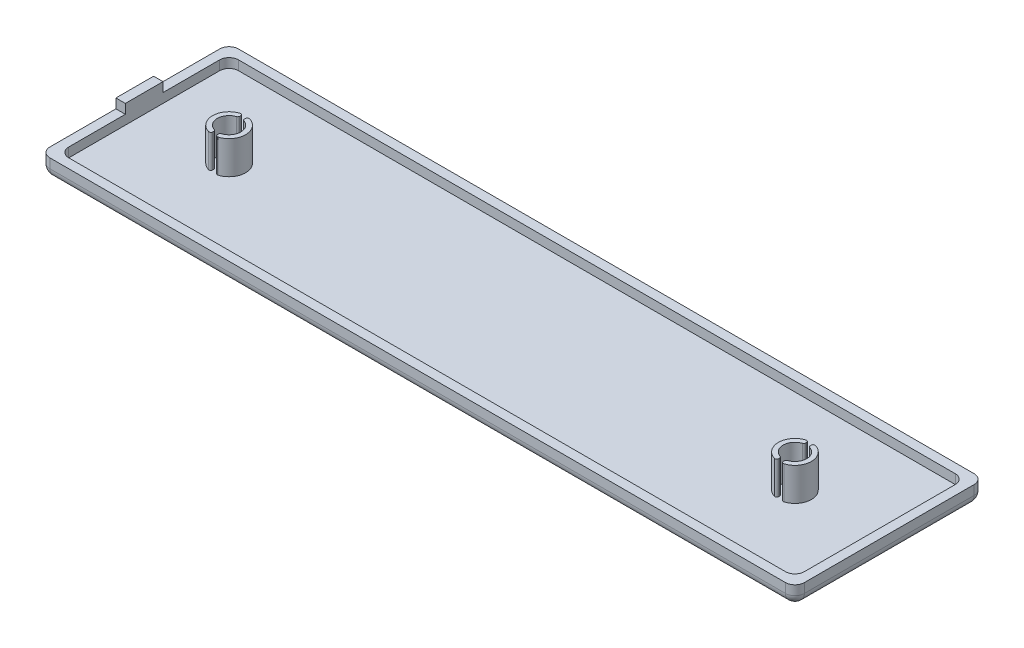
ISO-10303-21;
HEADER;
FILE_DESCRIPTION(('STEP AP214'),'2;1');
FILE_NAME('part.step','',(''),(''),'','','');
FILE_SCHEMA(('AUTOMOTIVE_DESIGN { 1 0 10303 214 1 1 1 1 }'));
ENDSEC;
DATA;
#1=APPLICATION_CONTEXT('core data for automotive mechanical design processes');
#2=APPLICATION_PROTOCOL_DEFINITION('international standard','automotive_design',2000,#1);
#3=PRODUCT_CONTEXT('',#1,'mechanical');
#4=PRODUCT('Part','Part','',(#3));
#5=PRODUCT_RELATED_PRODUCT_CATEGORY('part','',(#4));
#6=PRODUCT_DEFINITION_FORMATION('','',#4);
#7=PRODUCT_DEFINITION_CONTEXT('part definition',#1,'design');
#8=PRODUCT_DEFINITION('design','',#6,#7);
#9=PRODUCT_DEFINITION_SHAPE('','',#8);
#10=(LENGTH_UNIT() NAMED_UNIT(*) SI_UNIT(.MILLI.,.METRE.));
#11=(NAMED_UNIT(*) PLANE_ANGLE_UNIT() SI_UNIT($,.RADIAN.));
#12=(NAMED_UNIT(*) SI_UNIT($,.STERADIAN.) SOLID_ANGLE_UNIT());
#13=UNCERTAINTY_MEASURE_WITH_UNIT(LENGTH_MEASURE(1.E-05),#10,'distance_accuracy_value','');
#14=(GEOMETRIC_REPRESENTATION_CONTEXT(3) GLOBAL_UNCERTAINTY_ASSIGNED_CONTEXT((#13)) GLOBAL_UNIT_ASSIGNED_CONTEXT((#10,
#11,#12)) REPRESENTATION_CONTEXT('',''));
#15=CARTESIAN_POINT('',(0.,0.,0.));
#16=DIRECTION('',(0.,0.,1.));
#17=DIRECTION('',(1.,0.,0.));
#18=AXIS2_PLACEMENT_3D('',#15,#16,#17);
#19=CARTESIAN_POINT('',(0.,2.,0.));
#20=DIRECTION('',(0.,1.,0.));
#21=DIRECTION('',(0.,0.,1.));
#22=AXIS2_PLACEMENT_3D('',#19,#20,#21);
#23=PLANE('',#22);
#24=DIRECTION('',(1.,0.,0.));
#25=VECTOR('',#24,1.);
#26=CARTESIAN_POINT('',(0.,2.,-10.1864929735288));
#27=LINE('',#26,#25);
#28=CARTESIAN_POINT('',(-24.5518629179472,2.,-10.1864929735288));
#29=VERTEX_POINT('',#28);
#30=CARTESIAN_POINT('',(127.448137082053,2.,-10.1864929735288));
#31=VERTEX_POINT('',#30);
#32=EDGE_CURVE('E649',#29,#31,#27,.T.);
#33=ORIENTED_EDGE('',*,*,#32,.F.);
#34=CARTESIAN_POINT('',(-24.5518629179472,2.,-8.18649297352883));
#35=DIRECTION('',(0.,1.,0.));
#36=DIRECTION('',(0.,0.,1.));
#37=AXIS2_PLACEMENT_3D('',#34,#35,#36);
#38=CIRCLE('',#37,2.);
#39=CARTESIAN_POINT('',(-26.5518629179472,2.,-8.18649297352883));
#40=VERTEX_POINT('',#39);
#41=EDGE_CURVE('E501',#29,#40,#38,.T.);
#42=ORIENTED_EDGE('',*,*,#41,.T.);
#43=DIRECTION('',(0.,0.,1.));
#44=VECTOR('',#43,1.);
#45=CARTESIAN_POINT('',(-26.5518629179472,2.,0.));
#46=LINE('',#45,#44);
#47=CARTESIAN_POINT('',(-26.5518629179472,2.,23.8123254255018));
#48=VERTEX_POINT('',#47);
#49=EDGE_CURVE('E656',#40,#48,#46,.T.);
#50=ORIENTED_EDGE('',*,*,#49,.T.);
#51=CARTESIAN_POINT('',(-24.5518629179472,2.,23.8123254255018));
#52=DIRECTION('',(0.,1.,0.));
#53=DIRECTION('',(0.,0.,1.));
#54=AXIS2_PLACEMENT_3D('',#51,#52,#53);
#55=CIRCLE('',#54,2.);
#56=CARTESIAN_POINT('',(-24.5518629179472,2.,25.8123254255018));
#57=VERTEX_POINT('',#56);
#58=EDGE_CURVE('E492',#48,#57,#55,.T.);
#59=ORIENTED_EDGE('',*,*,#58,.T.);
#60=DIRECTION('',(1.,0.,0.));
#61=VECTOR('',#60,1.);
#62=CARTESIAN_POINT('',(0.,2.,25.8123254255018));
#63=LINE('',#62,#61);
#64=CARTESIAN_POINT('',(127.448137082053,2.,25.8123254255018));
#65=VERTEX_POINT('',#64);
#66=EDGE_CURVE('E664',#57,#65,#63,.T.);
#67=ORIENTED_EDGE('',*,*,#66,.T.);
#68=CARTESIAN_POINT('',(127.448137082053,2.,23.8123254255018));
#69=DIRECTION('',(0.,1.,0.));
#70=DIRECTION('',(0.,0.,1.));
#71=AXIS2_PLACEMENT_3D('',#68,#69,#70);
#72=CIRCLE('',#71,2.);
#73=CARTESIAN_POINT('',(129.448137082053,2.,23.8123254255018));
#74=VERTEX_POINT('',#73);
#75=EDGE_CURVE('E495',#65,#74,#72,.T.);
#76=ORIENTED_EDGE('',*,*,#75,.T.);
#77=DIRECTION('',(0.,0.,1.));
#78=VECTOR('',#77,1.);
#79=CARTESIAN_POINT('',(129.448137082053,2.,0.));
#80=LINE('',#79,#78);
#81=CARTESIAN_POINT('',(129.448137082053,2.,-8.18649297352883));
#82=VERTEX_POINT('',#81);
#83=EDGE_CURVE('E643',#82,#74,#80,.T.);
#84=ORIENTED_EDGE('',*,*,#83,.F.);
#85=CARTESIAN_POINT('',(127.448137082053,2.,-8.18649297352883));
#86=DIRECTION('',(0.,1.,0.));
#87=DIRECTION('',(0.,0.,1.));
#88=AXIS2_PLACEMENT_3D('',#85,#86,#87);
#89=CIRCLE('',#88,2.);
#90=EDGE_CURVE('E498',#82,#31,#89,.T.);
#91=ORIENTED_EDGE('',*,*,#90,.T.);
#92=EDGE_LOOP('',(#33,#42,#50,#59,#67,#76,#84,#91));
#93=FACE_BOUND('',#92,.T.);
#94=CARTESIAN_POINT('',(111.448137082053,2.,7.81232542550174));
#95=DIRECTION('',(0.,-1.,0.));
#96=DIRECTION('',(0.,0.,-1.));
#97=AXIS2_PLACEMENT_3D('',#94,#95,#96);
#98=CIRCLE('',#97,2.5);
#99=CARTESIAN_POINT('',(110.672275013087,2.,10.1888855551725));
#100=VERTEX_POINT('',#99);
#101=CARTESIAN_POINT('',(110.672275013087,2.,5.435765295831));
#102=VERTEX_POINT('',#101);
#103=EDGE_CURVE('E1393',#100,#102,#98,.T.);
#104=ORIENTED_EDGE('',*,*,#103,.F.);
#105=CARTESIAN_POINT('',(110.548137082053,2.,10.5691351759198));
#106=DIRECTION('',(0.,1.,0.));
#107=DIRECTION('',(0.,0.,1.));
#108=AXIS2_PLACEMENT_3D('',#105,#106,#107);
#109=CIRCLE('',#108,0.400000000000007);
#110=CARTESIAN_POINT('',(110.948137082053,2.,10.5691351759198));
#111=VERTEX_POINT('',#110);
#112=EDGE_CURVE('E1386',#111,#100,#109,.T.);
#113=ORIENTED_EDGE('',*,*,#112,.F.);
#114=DIRECTION('',(0.,0.,-1.));
#115=VECTOR('',#114,1.);
#116=CARTESIAN_POINT('',(110.948137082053,2.,10.5691351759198));
#117=LINE('',#116,#115);
#118=CARTESIAN_POINT('',(110.948137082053,2.,10.77880482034));
#119=VERTEX_POINT('',#118);
#120=EDGE_CURVE('E1421',#119,#111,#117,.T.);
#121=ORIENTED_EDGE('',*,*,#120,.F.);
#122=CARTESIAN_POINT('',(110.548137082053,2.,10.77880482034));
#123=DIRECTION('',(0.,1.,0.));
#124=DIRECTION('',(0.,0.,-1.));
#125=AXIS2_PLACEMENT_3D('',#122,#123,#124);
#126=CIRCLE('',#125,0.400000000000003);
#127=CARTESIAN_POINT('',(110.432008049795,2.,11.1615763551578));
#128=VERTEX_POINT('',#127);
#129=EDGE_CURVE('E1417',#128,#119,#126,.T.);
#130=ORIENTED_EDGE('',*,*,#129,.F.);
#131=CARTESIAN_POINT('',(111.448137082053,2.,7.81232542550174));
#132=DIRECTION('',(0.,1.,0.));
#133=DIRECTION('',(0.,0.,-1.));
#134=AXIS2_PLACEMENT_3D('',#131,#132,#133);
#135=CIRCLE('',#134,3.5);
#136=CARTESIAN_POINT('',(110.432008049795,2.,4.46307449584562));
#137=VERTEX_POINT('',#136);
#138=EDGE_CURVE('E1414',#137,#128,#135,.T.);
#139=ORIENTED_EDGE('',*,*,#138,.F.);
#140=CARTESIAN_POINT('',(110.548137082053,2.,4.84584603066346));
#141=DIRECTION('',(0.,1.,0.));
#142=DIRECTION('',(0.,0.,1.));
#143=AXIS2_PLACEMENT_3D('',#140,#141,#142);
#144=CIRCLE('',#143,0.399999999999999);
#145=CARTESIAN_POINT('',(110.948137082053,2.,4.84584603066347));
#146=VERTEX_POINT('',#145);
#147=EDGE_CURVE('E1411',#146,#137,#144,.T.);
#148=ORIENTED_EDGE('',*,*,#147,.F.);
#149=DIRECTION('',(0.,0.,-1.));
#150=VECTOR('',#149,1.);
#151=CARTESIAN_POINT('',(110.948137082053,2.,5.05551567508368));
#152=LINE('',#151,#150);
#153=CARTESIAN_POINT('',(110.948137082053,2.,5.05551567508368));
#154=VERTEX_POINT('',#153);
#155=EDGE_CURVE('E1405',#154,#146,#152,.T.);
#156=ORIENTED_EDGE('',*,*,#155,.F.);
#157=CARTESIAN_POINT('',(110.548137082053,2.,5.05551567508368));
#158=DIRECTION('',(0.,1.,0.));
#159=DIRECTION('',(0.,0.,-1.));
#160=AXIS2_PLACEMENT_3D('',#157,#158,#159);
#161=CIRCLE('',#160,0.399999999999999);
#162=EDGE_CURVE('E1399',#102,#154,#161,.T.);
#163=ORIENTED_EDGE('',*,*,#162,.F.);
#164=EDGE_LOOP('',(#104,#113,#121,#130,#139,#148,#156,#163));
#165=FACE_BOUND('',#164,.T.);
#166=DIRECTION('',(0.,0.,1.));
#167=VECTOR('',#166,1.);
#168=CARTESIAN_POINT('',(111.948137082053,2.,5.05551567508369));
#169=LINE('',#168,#167);
#170=CARTESIAN_POINT('',(111.948137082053,2.,4.84584603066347));
#171=VERTEX_POINT('',#170);
#172=CARTESIAN_POINT('',(111.948137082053,2.,5.05551567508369));
#173=VERTEX_POINT('',#172);
#174=EDGE_CURVE('E1536',#171,#173,#169,.T.);
#175=ORIENTED_EDGE('',*,*,#174,.F.);
#176=CARTESIAN_POINT('',(112.348137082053,2.,4.84584603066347));
#177=DIRECTION('',(0.,1.,0.));
#178=DIRECTION('',(0.,0.,-1.));
#179=AXIS2_PLACEMENT_3D('',#176,#177,#178);
#180=CIRCLE('',#179,0.400000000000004);
#181=CARTESIAN_POINT('',(112.464266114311,2.,4.46307449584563));
#182=VERTEX_POINT('',#181);
#183=EDGE_CURVE('E1539',#182,#171,#180,.T.);
#184=ORIENTED_EDGE('',*,*,#183,.F.);
#185=CARTESIAN_POINT('',(111.448137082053,2.,7.81232542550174));
#186=DIRECTION('',(0.,1.,0.));
#187=DIRECTION('',(0.,0.,-1.));
#188=AXIS2_PLACEMENT_3D('',#185,#186,#187);
#189=CIRCLE('',#188,3.5);
#190=CARTESIAN_POINT('',(112.464266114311,2.,11.1615763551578));
#191=VERTEX_POINT('',#190);
#192=EDGE_CURVE('E1516',#191,#182,#189,.T.);
#193=ORIENTED_EDGE('',*,*,#192,.F.);
#194=CARTESIAN_POINT('',(112.348137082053,2.,10.77880482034));
#195=DIRECTION('',(0.,1.,0.));
#196=DIRECTION('',(0.,0.,1.));
#197=AXIS2_PLACEMENT_3D('',#194,#195,#196);
#198=CIRCLE('',#197,0.4);
#199=CARTESIAN_POINT('',(111.948137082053,2.,10.77880482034));
#200=VERTEX_POINT('',#199);
#201=EDGE_CURVE('E1520',#200,#191,#198,.T.);
#202=ORIENTED_EDGE('',*,*,#201,.F.);
#203=DIRECTION('',(0.,0.,1.));
#204=VECTOR('',#203,1.);
#205=CARTESIAN_POINT('',(111.948137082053,2.,10.5691351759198));
#206=LINE('',#205,#204);
#207=CARTESIAN_POINT('',(111.948137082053,2.,10.5691351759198));
#208=VERTEX_POINT('',#207);
#209=EDGE_CURVE('E1524',#208,#200,#206,.T.);
#210=ORIENTED_EDGE('',*,*,#209,.F.);
#211=CARTESIAN_POINT('',(112.348137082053,2.,10.5691351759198));
#212=DIRECTION('',(0.,1.,0.));
#213=DIRECTION('',(0.,0.,-1.));
#214=AXIS2_PLACEMENT_3D('',#211,#212,#213);
#215=CIRCLE('',#214,0.399999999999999);
#216=CARTESIAN_POINT('',(112.223999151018,2.,10.1888855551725));
#217=VERTEX_POINT('',#216);
#218=EDGE_CURVE('E1527',#217,#208,#215,.T.);
#219=ORIENTED_EDGE('',*,*,#218,.F.);
#220=CARTESIAN_POINT('',(111.448137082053,2.,7.81232542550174));
#221=DIRECTION('',(0.,-1.,0.));
#222=DIRECTION('',(0.,0.,-1.));
#223=AXIS2_PLACEMENT_3D('',#220,#221,#222);
#224=CIRCLE('',#223,2.5);
#225=CARTESIAN_POINT('',(112.223999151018,2.,5.43576529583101));
#226=VERTEX_POINT('',#225);
#227=EDGE_CURVE('E1530',#226,#217,#224,.T.);
#228=ORIENTED_EDGE('',*,*,#227,.F.);
#229=CARTESIAN_POINT('',(112.348137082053,2.,5.05551567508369));
#230=DIRECTION('',(0.,1.,0.));
#231=DIRECTION('',(0.,0.,-1.));
#232=AXIS2_PLACEMENT_3D('',#229,#230,#231);
#233=CIRCLE('',#232,0.400000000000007);
#234=EDGE_CURVE('E1533',#173,#226,#233,.T.);
#235=ORIENTED_EDGE('',*,*,#234,.F.);
#236=EDGE_LOOP('',(#175,#184,#193,#202,#210,#219,#228,#235));
#237=FACE_BOUND('',#236,.T.);
#238=CARTESIAN_POINT('',(-8.55186291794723,2.,7.81232542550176));
#239=DIRECTION('',(0.,-1.,0.));
#240=DIRECTION('',(0.,0.,1.));
#241=AXIS2_PLACEMENT_3D('',#238,#239,#240);
#242=CIRCLE('',#241,2.5);
#243=CARTESIAN_POINT('',(-7.77600084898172,2.,5.43576529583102));
#244=VERTEX_POINT('',#243);
#245=CARTESIAN_POINT('',(-7.7760008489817,2.,10.1888855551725));
#246=VERTEX_POINT('',#245);
#247=EDGE_CURVE('E1617',#244,#246,#242,.T.);
#248=ORIENTED_EDGE('',*,*,#247,.F.);
#249=CARTESIAN_POINT('',(-7.65186291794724,2.,5.05551567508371));
#250=DIRECTION('',(0.,1.,0.));
#251=DIRECTION('',(0.,0.,1.));
#252=AXIS2_PLACEMENT_3D('',#249,#250,#251);
#253=CIRCLE('',#252,0.400000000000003);
#254=CARTESIAN_POINT('',(-8.05186291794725,2.,5.05551567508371));
#255=VERTEX_POINT('',#254);
#256=EDGE_CURVE('E1620',#255,#244,#253,.T.);
#257=ORIENTED_EDGE('',*,*,#256,.F.);
#258=DIRECTION('',(0.,0.,1.));
#259=VECTOR('',#258,1.);
#260=CARTESIAN_POINT('',(-8.05186291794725,2.,5.05551567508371));
#261=LINE('',#260,#259);
#262=CARTESIAN_POINT('',(-8.05186291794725,2.,4.84584603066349));
#263=VERTEX_POINT('',#262);
#264=EDGE_CURVE('E1597',#263,#255,#261,.T.);
#265=ORIENTED_EDGE('',*,*,#264,.F.);
#266=CARTESIAN_POINT('',(-7.65186291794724,2.,4.84584603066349));
#267=DIRECTION('',(0.,1.,0.));
#268=DIRECTION('',(0.,0.,-1.));
#269=AXIS2_PLACEMENT_3D('',#266,#267,#268);
#270=CIRCLE('',#269,0.400000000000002);
#271=CARTESIAN_POINT('',(-7.53573388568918,2.,4.46307449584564));
#272=VERTEX_POINT('',#271);
#273=EDGE_CURVE('E1601',#272,#263,#270,.T.);
#274=ORIENTED_EDGE('',*,*,#273,.F.);
#275=CARTESIAN_POINT('',(-8.55186291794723,2.,7.81232542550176));
#276=DIRECTION('',(0.,1.,0.));
#277=DIRECTION('',(0.,0.,1.));
#278=AXIS2_PLACEMENT_3D('',#275,#276,#277);
#279=CIRCLE('',#278,3.5);
#280=CARTESIAN_POINT('',(-7.53573388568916,2.,11.1615763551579));
#281=VERTEX_POINT('',#280);
#282=EDGE_CURVE('E1605',#281,#272,#279,.T.);
#283=ORIENTED_EDGE('',*,*,#282,.F.);
#284=CARTESIAN_POINT('',(-7.65186291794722,2.,10.77880482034));
#285=DIRECTION('',(0.,1.,0.));
#286=DIRECTION('',(0.,0.,1.));
#287=AXIS2_PLACEMENT_3D('',#284,#285,#286);
#288=CIRCLE('',#287,0.399999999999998);
#289=CARTESIAN_POINT('',(-8.05186291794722,2.,10.77880482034));
#290=VERTEX_POINT('',#289);
#291=EDGE_CURVE('E1608',#290,#281,#288,.T.);
#292=ORIENTED_EDGE('',*,*,#291,.F.);
#293=DIRECTION('',(0.,0.,1.));
#294=VECTOR('',#293,1.);
#295=CARTESIAN_POINT('',(-8.05186291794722,2.,10.5691351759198));
#296=LINE('',#295,#294);
#297=CARTESIAN_POINT('',(-8.05186291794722,2.,10.5691351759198));
#298=VERTEX_POINT('',#297);
#299=EDGE_CURVE('E1611',#298,#290,#296,.T.);
#300=ORIENTED_EDGE('',*,*,#299,.F.);
#301=CARTESIAN_POINT('',(-7.65186291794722,2.,10.5691351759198));
#302=DIRECTION('',(0.,1.,0.));
#303=DIRECTION('',(0.,0.,-1.));
#304=AXIS2_PLACEMENT_3D('',#301,#302,#303);
#305=CIRCLE('',#304,0.399999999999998);
#306=EDGE_CURVE('E1614',#246,#298,#305,.T.);
#307=ORIENTED_EDGE('',*,*,#306,.F.);
#308=EDGE_LOOP('',(#248,#257,#265,#274,#283,#292,#300,#307));
#309=FACE_BOUND('',#308,.T.);
#310=DIRECTION('',(0.,0.,-1.));
#311=VECTOR('',#310,1.);
#312=CARTESIAN_POINT('',(-9.05186291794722,2.,10.5691351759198));
#313=LINE('',#312,#311);
#314=CARTESIAN_POINT('',(-9.05186291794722,2.,10.77880482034));
#315=VERTEX_POINT('',#314);
#316=CARTESIAN_POINT('',(-9.05186291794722,2.,10.5691351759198));
#317=VERTEX_POINT('',#316);
#318=EDGE_CURVE('E1696',#315,#317,#313,.T.);
#319=ORIENTED_EDGE('',*,*,#318,.F.);
#320=CARTESIAN_POINT('',(-9.45186291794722,2.,10.77880482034));
#321=DIRECTION('',(0.,1.,0.));
#322=DIRECTION('',(0.,0.,-1.));
#323=AXIS2_PLACEMENT_3D('',#320,#321,#322);
#324=CIRCLE('',#323,0.400000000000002);
#325=CARTESIAN_POINT('',(-9.56799195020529,2.,11.1615763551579));
#326=VERTEX_POINT('',#325);
#327=EDGE_CURVE('E425',#326,#315,#324,.T.);
#328=ORIENTED_EDGE('',*,*,#327,.F.);
#329=CARTESIAN_POINT('',(-8.55186291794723,2.,7.81232542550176));
#330=DIRECTION('',(0.,1.,0.));
#331=DIRECTION('',(0.,0.,1.));
#332=AXIS2_PLACEMENT_3D('',#329,#330,#331);
#333=CIRCLE('',#332,3.5);
#334=CARTESIAN_POINT('',(-9.56799195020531,2.,4.46307449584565));
#335=VERTEX_POINT('',#334);
#336=EDGE_CURVE('E1677',#335,#326,#333,.T.);
#337=ORIENTED_EDGE('',*,*,#336,.F.);
#338=CARTESIAN_POINT('',(-9.45186291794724,2.,4.8458460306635));
#339=DIRECTION('',(0.,1.,0.));
#340=DIRECTION('',(0.,0.,1.));
#341=AXIS2_PLACEMENT_3D('',#338,#339,#340);
#342=CIRCLE('',#341,0.400000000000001);
#343=CARTESIAN_POINT('',(-9.05186291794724,2.,4.8458460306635));
#344=VERTEX_POINT('',#343);
#345=EDGE_CURVE('E1681',#344,#335,#342,.T.);
#346=ORIENTED_EDGE('',*,*,#345,.F.);
#347=DIRECTION('',(0.,0.,-1.));
#348=VECTOR('',#347,1.);
#349=CARTESIAN_POINT('',(-9.05186291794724,2.,5.05551567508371));
#350=LINE('',#349,#348);
#351=CARTESIAN_POINT('',(-9.05186291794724,2.,5.05551567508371));
#352=VERTEX_POINT('',#351);
#353=EDGE_CURVE('E1684',#352,#344,#350,.T.);
#354=ORIENTED_EDGE('',*,*,#353,.F.);
#355=CARTESIAN_POINT('',(-9.45186291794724,2.,5.05551567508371));
#356=DIRECTION('',(0.,1.,0.));
#357=DIRECTION('',(0.,0.,1.));
#358=AXIS2_PLACEMENT_3D('',#355,#356,#357);
#359=CIRCLE('',#358,0.400000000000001);
#360=CARTESIAN_POINT('',(-9.32772498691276,2.,5.43576529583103));
#361=VERTEX_POINT('',#360);
#362=EDGE_CURVE('E1687',#361,#352,#359,.T.);
#363=ORIENTED_EDGE('',*,*,#362,.F.);
#364=CARTESIAN_POINT('',(-8.55186291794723,2.,7.81232542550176));
#365=DIRECTION('',(0.,-1.,0.));
#366=DIRECTION('',(0.,0.,1.));
#367=AXIS2_PLACEMENT_3D('',#364,#365,#366);
#368=CIRCLE('',#367,2.5);
#369=CARTESIAN_POINT('',(-9.32772498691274,2.,10.1888855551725));
#370=VERTEX_POINT('',#369);
#371=EDGE_CURVE('E1690',#370,#361,#368,.T.);
#372=ORIENTED_EDGE('',*,*,#371,.F.);
#373=CARTESIAN_POINT('',(-9.45186291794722,2.,10.5691351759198));
#374=DIRECTION('',(0.,1.,0.));
#375=DIRECTION('',(0.,0.,1.));
#376=AXIS2_PLACEMENT_3D('',#373,#374,#375);
#377=CIRCLE('',#376,0.400000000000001);
#378=EDGE_CURVE('E1693',#317,#370,#377,.T.);
#379=ORIENTED_EDGE('',*,*,#378,.F.);
#380=EDGE_LOOP('',(#319,#328,#337,#346,#354,#363,#372,#379));
#381=FACE_BOUND('',#380,.T.);
#382=ADVANCED_FACE('F43',(#93,#165,#237,#309,#381),#23,.T.);
#383=CARTESIAN_POINT('',(0.,4.,0.));
#384=DIRECTION('',(0.,1.,0.));
#385=DIRECTION('',(0.,0.,1.));
#386=AXIS2_PLACEMENT_3D('',#383,#384,#385);
#387=PLANE('',#386);
#388=DIRECTION('',(-1.,0.,0.));
#389=VECTOR('',#388,1.);
#390=CARTESIAN_POINT('',(-26.5518629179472,4.,3.81232542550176));
#391=LINE('',#390,#389);
#392=CARTESIAN_POINT('',(-26.5518629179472,4.,3.81232542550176));
#393=VERTEX_POINT('',#392);
#394=CARTESIAN_POINT('',(-28.5518629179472,4.,3.81232542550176));
#395=VERTEX_POINT('',#394);
#396=EDGE_CURVE('E399',#393,#395,#391,.T.);
#397=ORIENTED_EDGE('',*,*,#396,.F.);
#398=DIRECTION('',(0.,0.,1.));
#399=VECTOR('',#398,1.);
#400=CARTESIAN_POINT('',(-26.5518629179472,4.,-10.1864929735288));
#401=LINE('',#400,#399);
#402=CARTESIAN_POINT('',(-26.5518629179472,4.,-8.18649297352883));
#403=VERTEX_POINT('',#402);
#404=EDGE_CURVE('E409',#403,#393,#401,.T.);
#405=ORIENTED_EDGE('',*,*,#404,.F.);
#406=CARTESIAN_POINT('',(-24.5518629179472,4.,-8.18649297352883));
#407=DIRECTION('',(0.,1.,0.));
#408=DIRECTION('',(0.,0.,1.));
#409=AXIS2_PLACEMENT_3D('',#406,#407,#408);
#410=CIRCLE('',#409,2.);
#411=CARTESIAN_POINT('',(-24.5518629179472,4.,-10.1864929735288));
#412=VERTEX_POINT('',#411);
#413=EDGE_CURVE('E564',#403,#412,#410,.F.);
#414=ORIENTED_EDGE('',*,*,#413,.T.);
#415=DIRECTION('',(-1.,0.,0.));
#416=VECTOR('',#415,1.);
#417=CARTESIAN_POINT('',(-26.5518629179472,4.,-10.1864929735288));
#418=LINE('',#417,#416);
#419=CARTESIAN_POINT('',(127.448137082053,4.,-10.1864929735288));
#420=VERTEX_POINT('',#419);
#421=EDGE_CURVE('E468',#420,#412,#418,.T.);
#422=ORIENTED_EDGE('',*,*,#421,.F.);
#423=CARTESIAN_POINT('',(127.448137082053,4.,-8.18649297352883));
#424=DIRECTION('',(0.,1.,0.));
#425=DIRECTION('',(0.,0.,1.));
#426=AXIS2_PLACEMENT_3D('',#423,#424,#425);
#427=CIRCLE('',#426,2.);
#428=CARTESIAN_POINT('',(129.448137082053,4.,-8.18649297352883));
#429=VERTEX_POINT('',#428);
#430=EDGE_CURVE('E567',#420,#429,#427,.F.);
#431=ORIENTED_EDGE('',*,*,#430,.T.);
#432=DIRECTION('',(0.,0.,-1.));
#433=VECTOR('',#432,1.);
#434=CARTESIAN_POINT('',(129.448137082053,4.,-10.1864929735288));
#435=LINE('',#434,#433);
#436=CARTESIAN_POINT('',(129.448137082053,4.,23.8123254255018));
#437=VERTEX_POINT('',#436);
#438=EDGE_CURVE('E675',#437,#429,#435,.T.);
#439=ORIENTED_EDGE('',*,*,#438,.F.);
#440=CARTESIAN_POINT('',(127.448137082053,4.,23.8123254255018));
#441=DIRECTION('',(0.,1.,0.));
#442=DIRECTION('',(0.,0.,1.));
#443=AXIS2_PLACEMENT_3D('',#440,#441,#442);
#444=CIRCLE('',#443,2.);
#445=CARTESIAN_POINT('',(127.448137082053,4.,25.8123254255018));
#446=VERTEX_POINT('',#445);
#447=EDGE_CURVE('E570',#437,#446,#444,.F.);
#448=ORIENTED_EDGE('',*,*,#447,.T.);
#449=DIRECTION('',(1.,0.,0.));
#450=VECTOR('',#449,1.);
#451=CARTESIAN_POINT('',(-26.5518629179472,4.,25.8123254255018));
#452=LINE('',#451,#450);
#453=CARTESIAN_POINT('',(-24.5518629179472,4.,25.8123254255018));
#454=VERTEX_POINT('',#453);
#455=EDGE_CURVE('E669',#454,#446,#452,.T.);
#456=ORIENTED_EDGE('',*,*,#455,.F.);
#457=CARTESIAN_POINT('',(-24.5518629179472,4.,23.8123254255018));
#458=DIRECTION('',(0.,1.,0.));
#459=DIRECTION('',(0.,0.,1.));
#460=AXIS2_PLACEMENT_3D('',#457,#458,#459);
#461=CIRCLE('',#460,2.);
#462=CARTESIAN_POINT('',(-26.5518629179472,4.,23.8123254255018));
#463=VERTEX_POINT('',#462);
#464=EDGE_CURVE('E573',#454,#463,#461,.F.);
#465=ORIENTED_EDGE('',*,*,#464,.T.);
#466=CARTESIAN_POINT('',(-26.5518629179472,4.,11.8123254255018));
#467=VERTEX_POINT('',#466);
#468=EDGE_CURVE('E433',#467,#463,#401,.T.);
#469=ORIENTED_EDGE('',*,*,#468,.F.);
#470=DIRECTION('',(-1.,0.,0.));
#471=VECTOR('',#470,1.);
#472=CARTESIAN_POINT('',(-26.5518629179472,4.,11.8123254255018));
#473=LINE('',#472,#471);
#474=CARTESIAN_POINT('',(-28.5518629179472,4.,11.8123254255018));
#475=VERTEX_POINT('',#474);
#476=EDGE_CURVE('E426',#467,#475,#473,.T.);
#477=ORIENTED_EDGE('',*,*,#476,.T.);
#478=DIRECTION('',(0.,0.,1.));
#479=VECTOR('',#478,1.);
#480=CARTESIAN_POINT('',(-28.5518629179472,4.,-12.1876745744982));
#481=LINE('',#480,#479);
#482=CARTESIAN_POINT('',(-28.5518629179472,4.,25.8123254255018));
#483=VERTEX_POINT('',#482);
#484=EDGE_CURVE('E461',#475,#483,#481,.T.);
#485=ORIENTED_EDGE('',*,*,#484,.T.);
#486=CARTESIAN_POINT('',(-26.5518629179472,4.,25.8123254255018));
#487=DIRECTION('',(0.,1.,0.));
#488=DIRECTION('',(0.,0.,1.));
#489=AXIS2_PLACEMENT_3D('',#486,#487,#488);
#490=CIRCLE('',#489,2.);
#491=CARTESIAN_POINT('',(-26.5518629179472,4.,27.8123254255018));
#492=VERTEX_POINT('',#491);
#493=EDGE_CURVE('E542',#483,#492,#490,.T.);
#494=ORIENTED_EDGE('',*,*,#493,.T.);
#495=DIRECTION('',(1.,0.,0.));
#496=VECTOR('',#495,1.);
#497=CARTESIAN_POINT('',(-28.5518629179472,4.,27.8123254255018));
#498=LINE('',#497,#496);
#499=CARTESIAN_POINT('',(129.448137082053,4.,27.8123254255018));
#500=VERTEX_POINT('',#499);
#501=EDGE_CURVE('E460',#492,#500,#498,.T.);
#502=ORIENTED_EDGE('',*,*,#501,.T.);
#503=CARTESIAN_POINT('',(129.448137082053,4.,25.8123254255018));
#504=DIRECTION('',(0.,1.,0.));
#505=DIRECTION('',(0.,0.,1.));
#506=AXIS2_PLACEMENT_3D('',#503,#504,#505);
#507=CIRCLE('',#506,2.);
#508=CARTESIAN_POINT('',(131.448137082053,4.,25.8123254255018));
#509=VERTEX_POINT('',#508);
#510=EDGE_CURVE('E539',#500,#509,#507,.T.);
#511=ORIENTED_EDGE('',*,*,#510,.T.);
#512=DIRECTION('',(0.,0.,-1.));
#513=VECTOR('',#512,1.);
#514=CARTESIAN_POINT('',(131.448137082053,4.,-12.1876745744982));
#515=LINE('',#514,#513);
#516=CARTESIAN_POINT('',(131.448137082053,4.,-10.1876745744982));
#517=VERTEX_POINT('',#516);
#518=EDGE_CURVE('E466',#509,#517,#515,.T.);
#519=ORIENTED_EDGE('',*,*,#518,.T.);
#520=CARTESIAN_POINT('',(129.448137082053,4.,-10.1876745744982));
#521=DIRECTION('',(0.,1.,0.));
#522=DIRECTION('',(0.,0.,1.));
#523=AXIS2_PLACEMENT_3D('',#520,#521,#522);
#524=CIRCLE('',#523,2.);
#525=CARTESIAN_POINT('',(129.448137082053,4.,-12.1876745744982));
#526=VERTEX_POINT('',#525);
#527=EDGE_CURVE('E545',#517,#526,#524,.T.);
#528=ORIENTED_EDGE('',*,*,#527,.T.);
#529=DIRECTION('',(-1.,0.,0.));
#530=VECTOR('',#529,1.);
#531=CARTESIAN_POINT('',(-28.5518629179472,4.,-12.1876745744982));
#532=LINE('',#531,#530);
#533=CARTESIAN_POINT('',(-26.5518629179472,4.,-12.1876745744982));
#534=VERTEX_POINT('',#533);
#535=EDGE_CURVE('E482',#526,#534,#532,.T.);
#536=ORIENTED_EDGE('',*,*,#535,.T.);
#537=CARTESIAN_POINT('',(-26.5518629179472,4.,-10.1876745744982));
#538=DIRECTION('',(0.,1.,0.));
#539=DIRECTION('',(0.,0.,1.));
#540=AXIS2_PLACEMENT_3D('',#537,#538,#539);
#541=CIRCLE('',#540,2.);
#542=CARTESIAN_POINT('',(-28.5518629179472,4.,-10.1876745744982));
#543=VERTEX_POINT('',#542);
#544=EDGE_CURVE('E458',#534,#543,#541,.T.);
#545=ORIENTED_EDGE('',*,*,#544,.T.);
#546=EDGE_CURVE('E452',#543,#395,#481,.T.);
#547=ORIENTED_EDGE('',*,*,#546,.T.);
#548=EDGE_LOOP('',(#397,#405,#414,#422,#431,#439,#448,#456,#465,#469,#477,#485,#494,#502,#511,
#519,#528,#536,#545,#547));
#549=FACE_BOUND('',#548,.T.);
#550=ADVANCED_FACE('F455',(#549),#387,.T.);
#551=CARTESIAN_POINT('',(0.,0.,0.));
#552=DIRECTION('',(0.,1.,0.));
#553=DIRECTION('',(0.,0.,1.));
#554=AXIS2_PLACEMENT_3D('',#551,#552,#553);
#555=PLANE('',#554);
#556=DIRECTION('',(0.,0.,-1.));
#557=VECTOR('',#556,1.);
#558=CARTESIAN_POINT('',(129.448137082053,0.,0.));
#559=LINE('',#558,#557);
#560=CARTESIAN_POINT('',(129.448137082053,0.,-10.1876745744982));
#561=VERTEX_POINT('',#560);
#562=CARTESIAN_POINT('',(129.448137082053,0.,25.8123254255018));
#563=VERTEX_POINT('',#562);
#564=EDGE_CURVE('E590',#561,#563,#559,.F.);
#565=ORIENTED_EDGE('',*,*,#564,.T.);
#566=DIRECTION('',(1.,0.,0.));
#567=VECTOR('',#566,1.);
#568=CARTESIAN_POINT('',(0.,0.,25.8123254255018));
#569=LINE('',#568,#567);
#570=CARTESIAN_POINT('',(-26.5518629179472,0.,25.8123254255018));
#571=VERTEX_POINT('',#570);
#572=EDGE_CURVE('E593',#563,#571,#569,.F.);
#573=ORIENTED_EDGE('',*,*,#572,.T.);
#574=DIRECTION('',(0.,0.,1.));
#575=VECTOR('',#574,1.);
#576=CARTESIAN_POINT('',(-26.5518629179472,0.,0.));
#577=LINE('',#576,#575);
#578=CARTESIAN_POINT('',(-26.5518629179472,0.,-10.1876745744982));
#579=VERTEX_POINT('',#578);
#580=EDGE_CURVE('E584',#571,#579,#577,.F.);
#581=ORIENTED_EDGE('',*,*,#580,.T.);
#582=DIRECTION('',(-1.,0.,0.));
#583=VECTOR('',#582,1.);
#584=CARTESIAN_POINT('',(0.,0.,-10.1876745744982));
#585=LINE('',#584,#583);
#586=EDGE_CURVE('E587',#579,#561,#585,.F.);
#587=ORIENTED_EDGE('',*,*,#586,.T.);
#588=EDGE_LOOP('',(#565,#573,#581,#587));
#589=FACE_BOUND('',#588,.T.);
#590=ADVANCED_FACE('F726',(#589),#555,.F.);
#591=CARTESIAN_POINT('',(-28.5518629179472,4.,-12.1876745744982));
#592=DIRECTION('',(1.,0.,0.));
#593=DIRECTION('',(0.,0.,-1.));
#594=AXIS2_PLACEMENT_3D('',#591,#592,#593);
#595=PLANE('',#594);
#596=DIRECTION('',(0.,-1.,0.));
#597=VECTOR('',#596,1.);
#598=CARTESIAN_POINT('',(-28.5518629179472,4.,-10.1876745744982));
#599=LINE('',#598,#597);
#600=CARTESIAN_POINT('',(-28.5518629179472,2.,-10.1876745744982));
#601=VERTEX_POINT('',#600);
#602=EDGE_CURVE('E529',#543,#601,#599,.T.);
#603=ORIENTED_EDGE('',*,*,#602,.T.);
#604=DIRECTION('',(0.,0.,1.));
#605=VECTOR('',#604,1.);
#606=CARTESIAN_POINT('',(-28.5518629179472,2.,-12.1876745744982));
#607=LINE('',#606,#605);
#608=CARTESIAN_POINT('',(-28.5518629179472,2.,25.8123254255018));
#609=VERTEX_POINT('',#608);
#610=EDGE_CURVE('E11',#601,#609,#607,.T.);
#611=ORIENTED_EDGE('',*,*,#610,.T.);
#612=DIRECTION('',(0.,-1.,0.));
#613=VECTOR('',#612,1.);
#614=CARTESIAN_POINT('',(-28.5518629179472,4.,25.8123254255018));
#615=LINE('',#614,#613);
#616=EDGE_CURVE('E525',#609,#483,#615,.F.);
#617=ORIENTED_EDGE('',*,*,#616,.T.);
#618=ORIENTED_EDGE('',*,*,#484,.F.);
#619=DIRECTION('',(0.,-1.,0.));
#620=VECTOR('',#619,1.);
#621=CARTESIAN_POINT('',(-28.5518629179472,0.,11.8123254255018));
#622=LINE('',#621,#620);
#623=CARTESIAN_POINT('',(-28.5518629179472,6.,11.8123254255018));
#624=VERTEX_POINT('',#623);
#625=EDGE_CURVE('E61',#624,#475,#622,.T.);
#626=ORIENTED_EDGE('',*,*,#625,.F.);
#627=DIRECTION('',(0.,0.,-1.));
#628=VECTOR('',#627,1.);
#629=CARTESIAN_POINT('',(-28.5518629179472,6.,0.));
#630=LINE('',#629,#628);
#631=CARTESIAN_POINT('',(-28.5518629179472,6.,3.81232542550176));
#632=VERTEX_POINT('',#631);
#633=EDGE_CURVE('E420',#624,#632,#630,.T.);
#634=ORIENTED_EDGE('',*,*,#633,.T.);
#635=DIRECTION('',(0.,-1.,0.));
#636=VECTOR('',#635,1.);
#637=CARTESIAN_POINT('',(-28.5518629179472,0.,3.81232542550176));
#638=LINE('',#637,#636);
#639=EDGE_CURVE('E393',#632,#395,#638,.T.);
#640=ORIENTED_EDGE('',*,*,#639,.T.);
#641=ORIENTED_EDGE('',*,*,#546,.F.);
#642=EDGE_LOOP('',(#603,#611,#617,#618,#626,#634,#640,#641));
#643=FACE_BOUND('',#642,.T.);
#644=ADVANCED_FACE('F451',(#643),#595,.F.);
#645=CARTESIAN_POINT('',(-28.5518629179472,4.,27.8123254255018));
#646=DIRECTION('',(0.,0.,-1.));
#647=DIRECTION('',(-1.,0.,0.));
#648=AXIS2_PLACEMENT_3D('',#645,#646,#647);
#649=PLANE('',#648);
#650=DIRECTION('',(0.,-1.,0.));
#651=VECTOR('',#650,1.);
#652=CARTESIAN_POINT('',(-26.5518629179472,4.,27.8123254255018));
#653=LINE('',#652,#651);
#654=CARTESIAN_POINT('',(-26.5518629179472,2.,27.8123254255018));
#655=VERTEX_POINT('',#654);
#656=EDGE_CURVE('E560',#492,#655,#653,.T.);
#657=ORIENTED_EDGE('',*,*,#656,.T.);
#658=DIRECTION('',(1.,0.,0.));
#659=VECTOR('',#658,1.);
#660=CARTESIAN_POINT('',(-28.5518629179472,2.,27.8123254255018));
#661=LINE('',#660,#659);
#662=CARTESIAN_POINT('',(129.448137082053,2.,27.8123254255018));
#663=VERTEX_POINT('',#662);
#664=EDGE_CURVE('E581',#655,#663,#661,.T.);
#665=ORIENTED_EDGE('',*,*,#664,.T.);
#666=DIRECTION('',(0.,-1.,0.));
#667=VECTOR('',#666,1.);
#668=CARTESIAN_POINT('',(129.448137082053,4.,27.8123254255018));
#669=LINE('',#668,#667);
#670=EDGE_CURVE('E557',#663,#500,#669,.F.);
#671=ORIENTED_EDGE('',*,*,#670,.T.);
#672=ORIENTED_EDGE('',*,*,#501,.F.);
#673=EDGE_LOOP('',(#657,#665,#671,#672));
#674=FACE_BOUND('',#673,.T.);
#675=ADVANCED_FACE('F748',(#674),#649,.F.);
#676=CARTESIAN_POINT('',(131.448137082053,4.,-12.1876745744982));
#677=DIRECTION('',(-1.,0.,0.));
#678=DIRECTION('',(0.,0.,1.));
#679=AXIS2_PLACEMENT_3D('',#676,#677,#678);
#680=PLANE('',#679);
#681=DIRECTION('',(0.,-1.,0.));
#682=VECTOR('',#681,1.);
#683=CARTESIAN_POINT('',(131.448137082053,4.,25.8123254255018));
#684=LINE('',#683,#682);
#685=CARTESIAN_POINT('',(131.448137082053,2.,25.8123254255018));
#686=VERTEX_POINT('',#685);
#687=EDGE_CURVE('E550',#509,#686,#684,.T.);
#688=ORIENTED_EDGE('',*,*,#687,.T.);
#689=DIRECTION('',(0.,0.,-1.));
#690=VECTOR('',#689,1.);
#691=CARTESIAN_POINT('',(131.448137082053,2.,-12.1876745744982));
#692=LINE('',#691,#690);
#693=CARTESIAN_POINT('',(131.448137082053,2.,-10.1876745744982));
#694=VERTEX_POINT('',#693);
#695=EDGE_CURVE('E600',#686,#694,#692,.T.);
#696=ORIENTED_EDGE('',*,*,#695,.T.);
#697=DIRECTION('',(0.,-1.,0.));
#698=VECTOR('',#697,1.);
#699=CARTESIAN_POINT('',(131.448137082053,4.,-10.1876745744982));
#700=LINE('',#699,#698);
#701=EDGE_CURVE('E554',#694,#517,#700,.F.);
#702=ORIENTED_EDGE('',*,*,#701,.T.);
#703=ORIENTED_EDGE('',*,*,#518,.F.);
#704=EDGE_LOOP('',(#688,#696,#702,#703));
#705=FACE_BOUND('',#704,.T.);
#706=ADVANCED_FACE('F744',(#705),#680,.F.);
#707=CARTESIAN_POINT('',(-28.5518629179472,4.,-12.1876745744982));
#708=DIRECTION('',(0.,0.,1.));
#709=DIRECTION('',(1.,0.,0.));
#710=AXIS2_PLACEMENT_3D('',#707,#708,#709);
#711=PLANE('',#710);
#712=DIRECTION('',(0.,-1.,0.));
#713=VECTOR('',#712,1.);
#714=CARTESIAN_POINT('',(129.448137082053,4.,-12.1876745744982));
#715=LINE('',#714,#713);
#716=CARTESIAN_POINT('',(129.448137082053,2.,-12.1876745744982));
#717=VERTEX_POINT('',#716);
#718=EDGE_CURVE('E532',#526,#717,#715,.T.);
#719=ORIENTED_EDGE('',*,*,#718,.T.);
#720=DIRECTION('',(-1.,0.,0.));
#721=VECTOR('',#720,1.);
#722=CARTESIAN_POINT('',(-28.5518629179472,2.,-12.1876745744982));
#723=LINE('',#722,#721);
#724=CARTESIAN_POINT('',(-26.5518629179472,2.,-12.1876745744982));
#725=VERTEX_POINT('',#724);
#726=EDGE_CURVE('E606',#717,#725,#723,.T.);
#727=ORIENTED_EDGE('',*,*,#726,.T.);
#728=DIRECTION('',(0.,-1.,0.));
#729=VECTOR('',#728,1.);
#730=CARTESIAN_POINT('',(-26.5518629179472,4.,-12.1876745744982));
#731=LINE('',#730,#729);
#732=EDGE_CURVE('E536',#725,#534,#731,.F.);
#733=ORIENTED_EDGE('',*,*,#732,.T.);
#734=ORIENTED_EDGE('',*,*,#535,.F.);
#735=EDGE_LOOP('',(#719,#727,#733,#734));
#736=FACE_BOUND('',#735,.T.);
#737=ADVANCED_FACE('F737',(#736),#711,.F.);
#738=CARTESIAN_POINT('',(-26.5518629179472,4.,-10.1864929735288));
#739=DIRECTION('',(1.,0.,0.));
#740=DIRECTION('',(0.,0.,-1.));
#741=AXIS2_PLACEMENT_3D('',#738,#739,#740);
#742=PLANE('',#741);
#743=ORIENTED_EDGE('',*,*,#49,.F.);
#744=DIRECTION('',(0.,-1.,0.));
#745=VECTOR('',#744,1.);
#746=CARTESIAN_POINT('',(-26.5518629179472,4.,-8.18649297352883));
#747=LINE('',#746,#745);
#748=EDGE_CURVE('E508',#40,#403,#747,.F.);
#749=ORIENTED_EDGE('',*,*,#748,.T.);
#750=ORIENTED_EDGE('',*,*,#404,.T.);
#751=DIRECTION('',(0.,-1.,0.));
#752=VECTOR('',#751,1.);
#753=CARTESIAN_POINT('',(-26.5518629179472,0.,3.81232542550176));
#754=LINE('',#753,#752);
#755=CARTESIAN_POINT('',(-26.5518629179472,6.,3.81232542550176));
#756=VERTEX_POINT('',#755);
#757=EDGE_CURVE('E390',#756,#393,#754,.T.);
#758=ORIENTED_EDGE('',*,*,#757,.F.);
#759=DIRECTION('',(0.,0.,-1.));
#760=VECTOR('',#759,1.);
#761=CARTESIAN_POINT('',(-26.5518629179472,6.,0.));
#762=LINE('',#761,#760);
#763=CARTESIAN_POINT('',(-26.5518629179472,6.,11.8123254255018));
#764=VERTEX_POINT('',#763);
#765=EDGE_CURVE('E407',#764,#756,#762,.T.);
#766=ORIENTED_EDGE('',*,*,#765,.F.);
#767=DIRECTION('',(0.,-1.,0.));
#768=VECTOR('',#767,1.);
#769=CARTESIAN_POINT('',(-26.5518629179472,0.,11.8123254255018));
#770=LINE('',#769,#768);
#771=EDGE_CURVE('E400',#764,#467,#770,.T.);
#772=ORIENTED_EDGE('',*,*,#771,.T.);
#773=ORIENTED_EDGE('',*,*,#468,.T.);
#774=DIRECTION('',(0.,-1.,0.));
#775=VECTOR('',#774,1.);
#776=CARTESIAN_POINT('',(-26.5518629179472,2.,23.8123254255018));
#777=LINE('',#776,#775);
#778=EDGE_CURVE('E504',#463,#48,#777,.T.);
#779=ORIENTED_EDGE('',*,*,#778,.T.);
#780=EDGE_LOOP('',(#743,#749,#750,#758,#766,#772,#773,#779));
#781=FACE_BOUND('',#780,.T.);
#782=ADVANCED_FACE('F406',(#781),#742,.T.);
#783=CARTESIAN_POINT('',(-26.5518629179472,4.,25.8123254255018));
#784=DIRECTION('',(0.,0.,-1.));
#785=DIRECTION('',(-1.,0.,0.));
#786=AXIS2_PLACEMENT_3D('',#783,#784,#785);
#787=PLANE('',#786);
#788=ORIENTED_EDGE('',*,*,#455,.T.);
#789=DIRECTION('',(0.,-1.,0.));
#790=VECTOR('',#789,1.);
#791=CARTESIAN_POINT('',(127.448137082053,2.,25.8123254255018));
#792=LINE('',#791,#790);
#793=EDGE_CURVE('E521',#446,#65,#792,.T.);
#794=ORIENTED_EDGE('',*,*,#793,.T.);
#795=ORIENTED_EDGE('',*,*,#66,.F.);
#796=DIRECTION('',(0.,-1.,0.));
#797=VECTOR('',#796,1.);
#798=CARTESIAN_POINT('',(-24.5518629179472,4.,25.8123254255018));
#799=LINE('',#798,#797);
#800=EDGE_CURVE('E518',#57,#454,#799,.F.);
#801=ORIENTED_EDGE('',*,*,#800,.T.);
#802=EDGE_LOOP('',(#788,#794,#795,#801));
#803=FACE_BOUND('',#802,.T.);
#804=ADVANCED_FACE('F688',(#803),#787,.T.);
#805=CARTESIAN_POINT('',(129.448137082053,4.,-10.1864929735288));
#806=DIRECTION('',(-1.,0.,0.));
#807=DIRECTION('',(0.,0.,1.));
#808=AXIS2_PLACEMENT_3D('',#805,#806,#807);
#809=PLANE('',#808);
#810=ORIENTED_EDGE('',*,*,#438,.T.);
#811=DIRECTION('',(0.,-1.,0.));
#812=VECTOR('',#811,1.);
#813=CARTESIAN_POINT('',(129.448137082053,2.,-8.18649297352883));
#814=LINE('',#813,#812);
#815=EDGE_CURVE('E514',#429,#82,#814,.T.);
#816=ORIENTED_EDGE('',*,*,#815,.T.);
#817=ORIENTED_EDGE('',*,*,#83,.T.);
#818=DIRECTION('',(0.,-1.,0.));
#819=VECTOR('',#818,1.);
#820=CARTESIAN_POINT('',(129.448137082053,4.,23.8123254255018));
#821=LINE('',#820,#819);
#822=EDGE_CURVE('E511',#74,#437,#821,.F.);
#823=ORIENTED_EDGE('',*,*,#822,.T.);
#824=EDGE_LOOP('',(#810,#816,#817,#823));
#825=FACE_BOUND('',#824,.T.);
#826=ADVANCED_FACE('F705',(#825),#809,.T.);
#827=CARTESIAN_POINT('',(-26.5518629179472,4.,-10.1864929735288));
#828=DIRECTION('',(0.,0.,1.));
#829=DIRECTION('',(1.,0.,0.));
#830=AXIS2_PLACEMENT_3D('',#827,#828,#829);
#831=PLANE('',#830);
#832=ORIENTED_EDGE('',*,*,#421,.T.);
#833=DIRECTION('',(0.,-1.,0.));
#834=VECTOR('',#833,1.);
#835=CARTESIAN_POINT('',(-24.5518629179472,2.,-10.1864929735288));
#836=LINE('',#835,#834);
#837=EDGE_CURVE('E488',#412,#29,#836,.T.);
#838=ORIENTED_EDGE('',*,*,#837,.T.);
#839=ORIENTED_EDGE('',*,*,#32,.T.);
#840=DIRECTION('',(0.,-1.,0.));
#841=VECTOR('',#840,1.);
#842=CARTESIAN_POINT('',(127.448137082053,4.,-10.1864929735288));
#843=LINE('',#842,#841);
#844=EDGE_CURVE('E485',#31,#420,#843,.F.);
#845=ORIENTED_EDGE('',*,*,#844,.T.);
#846=EDGE_LOOP('',(#832,#838,#839,#845));
#847=FACE_BOUND('',#846,.T.);
#848=ADVANCED_FACE('F698',(#847),#831,.T.);
#849=CARTESIAN_POINT('',(-24.5518629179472,4.,-8.18649297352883));
#850=DIRECTION('',(0.,1.,0.));
#851=DIRECTION('',(0.,0.,1.));
#852=AXIS2_PLACEMENT_3D('',#849,#850,#851);
#853=CYLINDRICAL_SURFACE('',#852,2.);
#854=ORIENTED_EDGE('',*,*,#413,.F.);
#855=ORIENTED_EDGE('',*,*,#748,.F.);
#856=ORIENTED_EDGE('',*,*,#41,.F.);
#857=ORIENTED_EDGE('',*,*,#837,.F.);
#858=EDGE_LOOP('',(#854,#855,#856,#857));
#859=FACE_BOUND('',#858,.T.);
#860=ADVANCED_FACE('F710',(#859),#853,.F.);
#861=CARTESIAN_POINT('',(127.448137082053,4.,-8.18649297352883));
#862=DIRECTION('',(0.,1.,0.));
#863=DIRECTION('',(0.,0.,1.));
#864=AXIS2_PLACEMENT_3D('',#861,#862,#863);
#865=CYLINDRICAL_SURFACE('',#864,2.);
#866=ORIENTED_EDGE('',*,*,#430,.F.);
#867=ORIENTED_EDGE('',*,*,#844,.F.);
#868=ORIENTED_EDGE('',*,*,#90,.F.);
#869=ORIENTED_EDGE('',*,*,#815,.F.);
#870=EDGE_LOOP('',(#866,#867,#868,#869));
#871=FACE_BOUND('',#870,.T.);
#872=ADVANCED_FACE('F702',(#871),#865,.F.);
#873=CARTESIAN_POINT('',(127.448137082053,4.,23.8123254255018));
#874=DIRECTION('',(0.,1.,0.));
#875=DIRECTION('',(0.,0.,1.));
#876=AXIS2_PLACEMENT_3D('',#873,#874,#875);
#877=CYLINDRICAL_SURFACE('',#876,2.);
#878=ORIENTED_EDGE('',*,*,#447,.F.);
#879=ORIENTED_EDGE('',*,*,#822,.F.);
#880=ORIENTED_EDGE('',*,*,#75,.F.);
#881=ORIENTED_EDGE('',*,*,#793,.F.);
#882=EDGE_LOOP('',(#878,#879,#880,#881));
#883=FACE_BOUND('',#882,.T.);
#884=ADVANCED_FACE('F692',(#883),#877,.F.);
#885=CARTESIAN_POINT('',(-24.5518629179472,4.,23.8123254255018));
#886=DIRECTION('',(0.,1.,0.));
#887=DIRECTION('',(0.,0.,1.));
#888=AXIS2_PLACEMENT_3D('',#885,#886,#887);
#889=CYLINDRICAL_SURFACE('',#888,2.);
#890=ORIENTED_EDGE('',*,*,#464,.F.);
#891=ORIENTED_EDGE('',*,*,#800,.F.);
#892=ORIENTED_EDGE('',*,*,#58,.F.);
#893=ORIENTED_EDGE('',*,*,#778,.F.);
#894=EDGE_LOOP('',(#890,#891,#892,#893));
#895=FACE_BOUND('',#894,.T.);
#896=ADVANCED_FACE('F682',(#895),#889,.F.);
#897=CARTESIAN_POINT('',(-26.5518629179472,4.,-10.1876745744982));
#898=DIRECTION('',(0.,-1.,0.));
#899=DIRECTION('',(0.,0.,-1.));
#900=AXIS2_PLACEMENT_3D('',#897,#898,#899);
#901=CYLINDRICAL_SURFACE('',#900,2.);
#902=ORIENTED_EDGE('',*,*,#732,.F.);
#903=CARTESIAN_POINT('',(-26.5518629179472,2.,-10.1876745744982));
#904=DIRECTION('',(0.,-1.,0.));
#905=DIRECTION('',(0.,0.,-1.));
#906=AXIS2_PLACEMENT_3D('',#903,#904,#905);
#907=CIRCLE('',#906,2.);
#908=EDGE_CURVE('E53',#725,#601,#907,.F.);
#909=ORIENTED_EDGE('',*,*,#908,.T.);
#910=ORIENTED_EDGE('',*,*,#602,.F.);
#911=ORIENTED_EDGE('',*,*,#544,.F.);
#912=EDGE_LOOP('',(#902,#909,#910,#911));
#913=FACE_BOUND('',#912,.T.);
#914=ADVANCED_FACE('F815',(#913),#901,.T.);
#915=CARTESIAN_POINT('',(129.448137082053,4.,-10.1876745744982));
#916=DIRECTION('',(0.,-1.,0.));
#917=DIRECTION('',(0.,0.,-1.));
#918=AXIS2_PLACEMENT_3D('',#915,#916,#917);
#919=CYLINDRICAL_SURFACE('',#918,2.);
#920=ORIENTED_EDGE('',*,*,#701,.F.);
#921=CARTESIAN_POINT('',(129.448137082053,2.,-10.1876745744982));
#922=DIRECTION('',(0.,-1.,0.));
#923=DIRECTION('',(0.,0.,-1.));
#924=AXIS2_PLACEMENT_3D('',#921,#922,#923);
#925=CIRCLE('',#924,2.);
#926=EDGE_CURVE('E603',#694,#717,#925,.F.);
#927=ORIENTED_EDGE('',*,*,#926,.T.);
#928=ORIENTED_EDGE('',*,*,#718,.F.);
#929=ORIENTED_EDGE('',*,*,#527,.F.);
#930=EDGE_LOOP('',(#920,#927,#928,#929));
#931=FACE_BOUND('',#930,.T.);
#932=ADVANCED_FACE('F1231',(#931),#919,.T.);
#933=CARTESIAN_POINT('',(-26.5518629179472,4.,25.8123254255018));
#934=DIRECTION('',(0.,-1.,0.));
#935=DIRECTION('',(0.,0.,-1.));
#936=AXIS2_PLACEMENT_3D('',#933,#934,#935);
#937=CYLINDRICAL_SURFACE('',#936,2.);
#938=ORIENTED_EDGE('',*,*,#616,.F.);
#939=CARTESIAN_POINT('',(-26.5518629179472,2.,25.8123254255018));
#940=DIRECTION('',(0.,-1.,0.));
#941=DIRECTION('',(0.,0.,-1.));
#942=AXIS2_PLACEMENT_3D('',#939,#940,#941);
#943=CIRCLE('',#942,2.);
#944=EDGE_CURVE('E577',#609,#655,#943,.F.);
#945=ORIENTED_EDGE('',*,*,#944,.T.);
#946=ORIENTED_EDGE('',*,*,#656,.F.);
#947=ORIENTED_EDGE('',*,*,#493,.F.);
#948=EDGE_LOOP('',(#938,#945,#946,#947));
#949=FACE_BOUND('',#948,.T.);
#950=ADVANCED_FACE('F1223',(#949),#937,.T.);
#951=CARTESIAN_POINT('',(129.448137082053,4.,25.8123254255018));
#952=DIRECTION('',(0.,-1.,0.));
#953=DIRECTION('',(0.,0.,-1.));
#954=AXIS2_PLACEMENT_3D('',#951,#952,#953);
#955=CYLINDRICAL_SURFACE('',#954,2.);
#956=ORIENTED_EDGE('',*,*,#670,.F.);
#957=CARTESIAN_POINT('',(129.448137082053,2.,25.8123254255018));
#958=DIRECTION('',(0.,-1.,0.));
#959=DIRECTION('',(0.,0.,-1.));
#960=AXIS2_PLACEMENT_3D('',#957,#958,#959);
#961=CIRCLE('',#960,2.);
#962=EDGE_CURVE('E597',#663,#686,#961,.F.);
#963=ORIENTED_EDGE('',*,*,#962,.T.);
#964=ORIENTED_EDGE('',*,*,#687,.F.);
#965=ORIENTED_EDGE('',*,*,#510,.F.);
#966=EDGE_LOOP('',(#956,#963,#964,#965));
#967=FACE_BOUND('',#966,.T.);
#968=ADVANCED_FACE('F1216',(#967),#955,.T.);
#969=CARTESIAN_POINT('',(129.448137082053,2.,-10.1876745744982));
#970=DIRECTION('',(0.,0.,1.));
#971=DIRECTION('',(1.,0.,0.));
#972=AXIS2_PLACEMENT_3D('',#969,#970,#971);
#973=SPHERICAL_SURFACE('',#972,2.);
#974=CARTESIAN_POINT('',(129.448137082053,2.,-10.1876745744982));
#975=DIRECTION('',(-1.,0.,0.));
#976=DIRECTION('',(0.,0.,1.));
#977=AXIS2_PLACEMENT_3D('',#974,#975,#976);
#978=CIRCLE('',#977,2.);
#979=EDGE_CURVE('E633',#717,#561,#978,.T.);
#980=ORIENTED_EDGE('',*,*,#979,.F.);
#981=ORIENTED_EDGE('',*,*,#926,.F.);
#982=CARTESIAN_POINT('',(129.448137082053,2.,-10.1876745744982));
#983=DIRECTION('',(0.,0.,1.));
#984=DIRECTION('',(1.,0.,0.));
#985=AXIS2_PLACEMENT_3D('',#982,#983,#984);
#986=CIRCLE('',#985,2.);
#987=EDGE_CURVE('E472',#561,#694,#986,.T.);
#988=ORIENTED_EDGE('',*,*,#987,.F.);
#989=EDGE_LOOP('',(#980,#981,#988));
#990=FACE_BOUND('',#989,.T.);
#991=ADVANCED_FACE('F45',(#990),#973,.T.);
#992=CARTESIAN_POINT('',(129.448137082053,2.,-12.1876745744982));
#993=DIRECTION('',(0.,0.,-1.));
#994=DIRECTION('',(-1.,0.,0.));
#995=AXIS2_PLACEMENT_3D('',#992,#993,#994);
#996=CYLINDRICAL_SURFACE('',#995,2.);
#997=ORIENTED_EDGE('',*,*,#987,.T.);
#998=ORIENTED_EDGE('',*,*,#695,.F.);
#999=CARTESIAN_POINT('',(129.448137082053,2.,25.8123254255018));
#1000=DIRECTION('',(0.,0.,1.));
#1001=DIRECTION('',(1.,0.,0.));
#1002=AXIS2_PLACEMENT_3D('',#999,#1000,#1001);
#1003=CIRCLE('',#1002,2.);
#1004=EDGE_CURVE('E630',#563,#686,#1003,.T.);
#1005=ORIENTED_EDGE('',*,*,#1004,.F.);
#1006=ORIENTED_EDGE('',*,*,#564,.F.);
#1007=EDGE_LOOP('',(#997,#998,#1005,#1006));
#1008=FACE_BOUND('',#1007,.T.);
#1009=ADVANCED_FACE('F1204',(#1008),#996,.T.);
#1010=CARTESIAN_POINT('',(-28.5518629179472,2.,-10.1876745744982));
#1011=DIRECTION('',(-1.,0.,0.));
#1012=DIRECTION('',(0.,0.,1.));
#1013=AXIS2_PLACEMENT_3D('',#1010,#1011,#1012);
#1014=CYLINDRICAL_SURFACE('',#1013,2.);
#1015=ORIENTED_EDGE('',*,*,#979,.T.);
#1016=ORIENTED_EDGE('',*,*,#586,.F.);
#1017=CARTESIAN_POINT('',(-26.5518629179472,2.,-10.1876745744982));
#1018=DIRECTION('',(-1.,0.,0.));
#1019=DIRECTION('',(0.,0.,1.));
#1020=AXIS2_PLACEMENT_3D('',#1017,#1018,#1019);
#1021=CIRCLE('',#1020,2.);
#1022=EDGE_CURVE('E626',#725,#579,#1021,.T.);
#1023=ORIENTED_EDGE('',*,*,#1022,.F.);
#1024=ORIENTED_EDGE('',*,*,#726,.F.);
#1025=EDGE_LOOP('',(#1015,#1016,#1023,#1024));
#1026=FACE_BOUND('',#1025,.T.);
#1027=ADVANCED_FACE('F1196',(#1026),#1014,.T.);
#1028=CARTESIAN_POINT('',(129.448137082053,2.,25.8123254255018));
#1029=DIRECTION('',(0.,0.,1.));
#1030=DIRECTION('',(1.,0.,0.));
#1031=AXIS2_PLACEMENT_3D('',#1028,#1029,#1030);
#1032=SPHERICAL_SURFACE('',#1031,2.);
#1033=ORIENTED_EDGE('',*,*,#1004,.T.);
#1034=ORIENTED_EDGE('',*,*,#962,.F.);
#1035=CARTESIAN_POINT('',(129.448137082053,2.,25.8123254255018));
#1036=DIRECTION('',(-1.,0.,0.));
#1037=DIRECTION('',(0.,0.,1.));
#1038=AXIS2_PLACEMENT_3D('',#1035,#1036,#1037);
#1039=CIRCLE('',#1038,2.);
#1040=EDGE_CURVE('E622',#563,#663,#1039,.T.);
#1041=ORIENTED_EDGE('',*,*,#1040,.F.);
#1042=EDGE_LOOP('',(#1033,#1034,#1041));
#1043=FACE_BOUND('',#1042,.T.);
#1044=ADVANCED_FACE('F1188',(#1043),#1032,.T.);
#1045=CARTESIAN_POINT('',(-26.5518629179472,2.,-10.1876745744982));
#1046=DIRECTION('',(0.,0.,1.));
#1047=DIRECTION('',(1.,0.,0.));
#1048=AXIS2_PLACEMENT_3D('',#1045,#1046,#1047);
#1049=SPHERICAL_SURFACE('',#1048,2.);
#1050=ORIENTED_EDGE('',*,*,#908,.F.);
#1051=ORIENTED_EDGE('',*,*,#1022,.T.);
#1052=CARTESIAN_POINT('',(-26.5518629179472,2.,-10.1876745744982));
#1053=DIRECTION('',(0.,0.,1.));
#1054=DIRECTION('',(1.,0.,0.));
#1055=AXIS2_PLACEMENT_3D('',#1052,#1053,#1054);
#1056=CIRCLE('',#1055,2.);
#1057=EDGE_CURVE('E618',#601,#579,#1056,.T.);
#1058=ORIENTED_EDGE('',*,*,#1057,.F.);
#1059=EDGE_LOOP('',(#1050,#1051,#1058));
#1060=FACE_BOUND('',#1059,.T.);
#1061=ADVANCED_FACE('F1180',(#1060),#1049,.T.);
#1062=CARTESIAN_POINT('',(-28.5518629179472,2.,25.8123254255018));
#1063=DIRECTION('',(1.,0.,0.));
#1064=DIRECTION('',(0.,0.,-1.));
#1065=AXIS2_PLACEMENT_3D('',#1062,#1063,#1064);
#1066=CYLINDRICAL_SURFACE('',#1065,2.);
#1067=ORIENTED_EDGE('',*,*,#1040,.T.);
#1068=ORIENTED_EDGE('',*,*,#664,.F.);
#1069=CARTESIAN_POINT('',(-26.5518629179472,2.,25.8123254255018));
#1070=DIRECTION('',(-1.,0.,0.));
#1071=DIRECTION('',(0.,0.,1.));
#1072=AXIS2_PLACEMENT_3D('',#1069,#1070,#1071);
#1073=CIRCLE('',#1072,2.);
#1074=EDGE_CURVE('E614',#571,#655,#1073,.T.);
#1075=ORIENTED_EDGE('',*,*,#1074,.F.);
#1076=ORIENTED_EDGE('',*,*,#572,.F.);
#1077=EDGE_LOOP('',(#1067,#1068,#1075,#1076));
#1078=FACE_BOUND('',#1077,.T.);
#1079=ADVANCED_FACE('F1172',(#1078),#1066,.T.);
#1080=CARTESIAN_POINT('',(-26.5518629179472,2.,-12.1876745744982));
#1081=DIRECTION('',(0.,0.,1.));
#1082=DIRECTION('',(1.,0.,0.));
#1083=AXIS2_PLACEMENT_3D('',#1080,#1081,#1082);
#1084=CYLINDRICAL_SURFACE('',#1083,2.);
#1085=ORIENTED_EDGE('',*,*,#1057,.T.);
#1086=ORIENTED_EDGE('',*,*,#580,.F.);
#1087=CARTESIAN_POINT('',(-26.5518629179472,2.,25.8123254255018));
#1088=DIRECTION('',(0.,0.,1.));
#1089=DIRECTION('',(1.,0.,0.));
#1090=AXIS2_PLACEMENT_3D('',#1087,#1088,#1089);
#1091=CIRCLE('',#1090,2.);
#1092=EDGE_CURVE('E611',#609,#571,#1091,.T.);
#1093=ORIENTED_EDGE('',*,*,#1092,.F.);
#1094=ORIENTED_EDGE('',*,*,#610,.F.);
#1095=EDGE_LOOP('',(#1085,#1086,#1093,#1094));
#1096=FACE_BOUND('',#1095,.T.);
#1097=ADVANCED_FACE('F1164',(#1096),#1084,.T.);
#1098=CARTESIAN_POINT('',(-26.5518629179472,2.,25.8123254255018));
#1099=DIRECTION('',(0.,0.,1.));
#1100=DIRECTION('',(1.,0.,0.));
#1101=AXIS2_PLACEMENT_3D('',#1098,#1099,#1100);
#1102=SPHERICAL_SURFACE('',#1101,2.);
#1103=ORIENTED_EDGE('',*,*,#1074,.T.);
#1104=ORIENTED_EDGE('',*,*,#944,.F.);
#1105=ORIENTED_EDGE('',*,*,#1092,.T.);
#1106=EDGE_LOOP('',(#1103,#1104,#1105));
#1107=FACE_BOUND('',#1106,.T.);
#1108=ADVANCED_FACE('F1157',(#1107),#1102,.T.);
#1109=CARTESIAN_POINT('',(110.548137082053,9.,10.5691351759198));
#1110=DIRECTION('',(0.,-1.,0.));
#1111=DIRECTION('',(0.,0.,-1.));
#1112=AXIS2_PLACEMENT_3D('',#1109,#1110,#1111);
#1113=CYLINDRICAL_SURFACE('',#1112,0.400000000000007);
#1114=ORIENTED_EDGE('',*,*,#112,.T.);
#1115=DIRECTION('',(0.,-1.,0.));
#1116=VECTOR('',#1115,1.);
#1117=CARTESIAN_POINT('',(110.672275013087,9.,10.1888855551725));
#1118=LINE('',#1117,#1116);
#1119=CARTESIAN_POINT('',(110.672275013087,9.,10.1888855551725));
#1120=VERTEX_POINT('',#1119);
#1121=EDGE_CURVE('E615',#1120,#100,#1118,.T.);
#1122=ORIENTED_EDGE('',*,*,#1121,.F.);
#1123=CARTESIAN_POINT('',(110.548137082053,9.,10.5691351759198));
#1124=DIRECTION('',(0.,1.,0.));
#1125=DIRECTION('',(0.,0.,1.));
#1126=AXIS2_PLACEMENT_3D('',#1123,#1124,#1125);
#1127=CIRCLE('',#1126,0.400000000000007);
#1128=CARTESIAN_POINT('',(110.948137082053,9.,10.5691351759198));
#1129=VERTEX_POINT('',#1128);
#1130=EDGE_CURVE('E1424',#1129,#1120,#1127,.T.);
#1131=ORIENTED_EDGE('',*,*,#1130,.F.);
#1132=DIRECTION('',(0.,-1.,0.));
#1133=VECTOR('',#1132,1.);
#1134=CARTESIAN_POINT('',(110.948137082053,9.,10.5691351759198));
#1135=LINE('',#1134,#1133);
#1136=EDGE_CURVE('E1390',#1129,#111,#1135,.T.);
#1137=ORIENTED_EDGE('',*,*,#1136,.T.);
#1138=EDGE_LOOP('',(#1114,#1122,#1131,#1137));
#1139=FACE_BOUND('',#1138,.T.);
#1140=ADVANCED_FACE('F729',(#1139),#1113,.T.);
#1141=CARTESIAN_POINT('',(111.448137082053,9.,7.81232542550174));
#1142=DIRECTION('',(0.,-1.,0.));
#1143=DIRECTION('',(0.,0.,-1.));
#1144=AXIS2_PLACEMENT_3D('',#1141,#1142,#1143);
#1145=CYLINDRICAL_SURFACE('',#1144,2.5);
#1146=ORIENTED_EDGE('',*,*,#103,.T.);
#1147=DIRECTION('',(0.,-1.,0.));
#1148=VECTOR('',#1147,1.);
#1149=CARTESIAN_POINT('',(110.672275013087,9.,5.435765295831));
#1150=LINE('',#1149,#1148);
#1151=CARTESIAN_POINT('',(110.672275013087,9.,5.435765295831));
#1152=VERTEX_POINT('',#1151);
#1153=EDGE_CURVE('E1446',#1152,#102,#1150,.T.);
#1154=ORIENTED_EDGE('',*,*,#1153,.F.);
#1155=CARTESIAN_POINT('',(111.448137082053,9.,7.81232542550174));
#1156=DIRECTION('',(0.,-1.,0.));
#1157=DIRECTION('',(0.,0.,-1.));
#1158=AXIS2_PLACEMENT_3D('',#1155,#1156,#1157);
#1159=CIRCLE('',#1158,2.5);
#1160=EDGE_CURVE('E1450',#1120,#1152,#1159,.T.);
#1161=ORIENTED_EDGE('',*,*,#1160,.F.);
#1162=ORIENTED_EDGE('',*,*,#1121,.T.);
#1163=EDGE_LOOP('',(#1146,#1154,#1161,#1162));
#1164=FACE_BOUND('',#1163,.T.);
#1165=ADVANCED_FACE('F1143',(#1164),#1145,.F.);
#1166=CARTESIAN_POINT('',(110.548137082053,9.,5.05551567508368));
#1167=DIRECTION('',(0.,-1.,0.));
#1168=DIRECTION('',(0.,0.,-1.));
#1169=AXIS2_PLACEMENT_3D('',#1166,#1167,#1168);
#1170=CYLINDRICAL_SURFACE('',#1169,0.399999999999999);
#1171=ORIENTED_EDGE('',*,*,#162,.T.);
#1172=DIRECTION('',(0.,-1.,0.));
#1173=VECTOR('',#1172,1.);
#1174=CARTESIAN_POINT('',(110.948137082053,9.,5.05551567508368));
#1175=LINE('',#1174,#1173);
#1176=CARTESIAN_POINT('',(110.948137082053,9.,5.05551567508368));
#1177=VERTEX_POINT('',#1176);
#1178=EDGE_CURVE('E1443',#1177,#154,#1175,.T.);
#1179=ORIENTED_EDGE('',*,*,#1178,.F.);
#1180=CARTESIAN_POINT('',(110.548137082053,9.,5.05551567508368));
#1181=DIRECTION('',(0.,1.,0.));
#1182=DIRECTION('',(0.,0.,-1.));
#1183=AXIS2_PLACEMENT_3D('',#1180,#1181,#1182);
#1184=CIRCLE('',#1183,0.399999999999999);
#1185=EDGE_CURVE('E1453',#1152,#1177,#1184,.T.);
#1186=ORIENTED_EDGE('',*,*,#1185,.F.);
#1187=ORIENTED_EDGE('',*,*,#1153,.T.);
#1188=EDGE_LOOP('',(#1171,#1179,#1186,#1187));
#1189=FACE_BOUND('',#1188,.T.);
#1190=ADVANCED_FACE('F1135',(#1189),#1170,.T.);
#1191=CARTESIAN_POINT('',(110.948137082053,9.,5.05551567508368));
#1192=DIRECTION('',(-1.,0.,0.));
#1193=DIRECTION('',(0.,0.,1.));
#1194=AXIS2_PLACEMENT_3D('',#1191,#1192,#1193);
#1195=PLANE('',#1194);
#1196=ORIENTED_EDGE('',*,*,#155,.T.);
#1197=DIRECTION('',(0.,-1.,0.));
#1198=VECTOR('',#1197,1.);
#1199=CARTESIAN_POINT('',(110.948137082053,9.,4.84584603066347));
#1200=LINE('',#1199,#1198);
#1201=CARTESIAN_POINT('',(110.948137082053,9.,4.84584603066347));
#1202=VERTEX_POINT('',#1201);
#1203=EDGE_CURVE('E1439',#1202,#146,#1200,.T.);
#1204=ORIENTED_EDGE('',*,*,#1203,.F.);
#1205=DIRECTION('',(0.,0.,-1.));
#1206=VECTOR('',#1205,1.);
#1207=CARTESIAN_POINT('',(110.948137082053,9.,5.05551567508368));
#1208=LINE('',#1207,#1206);
#1209=EDGE_CURVE('E1463',#1177,#1202,#1208,.T.);
#1210=ORIENTED_EDGE('',*,*,#1209,.F.);
#1211=ORIENTED_EDGE('',*,*,#1178,.T.);
#1212=EDGE_LOOP('',(#1196,#1204,#1210,#1211));
#1213=FACE_BOUND('',#1212,.T.);
#1214=ADVANCED_FACE('F1127',(#1213),#1195,.F.);
#1215=CARTESIAN_POINT('',(110.548137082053,9.,4.84584603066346));
#1216=DIRECTION('',(0.,-1.,0.));
#1217=DIRECTION('',(0.,0.,-1.));
#1218=AXIS2_PLACEMENT_3D('',#1215,#1216,#1217);
#1219=CYLINDRICAL_SURFACE('',#1218,0.399999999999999);
#1220=ORIENTED_EDGE('',*,*,#147,.T.);
#1221=DIRECTION('',(0.,-1.,0.));
#1222=VECTOR('',#1221,1.);
#1223=CARTESIAN_POINT('',(110.432008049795,9.,4.46307449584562));
#1224=LINE('',#1223,#1222);
#1225=CARTESIAN_POINT('',(110.432008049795,9.,4.46307449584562));
#1226=VERTEX_POINT('',#1225);
#1227=EDGE_CURVE('E1435',#1226,#137,#1224,.T.);
#1228=ORIENTED_EDGE('',*,*,#1227,.F.);
#1229=CARTESIAN_POINT('',(110.548137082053,9.,4.84584603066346));
#1230=DIRECTION('',(0.,1.,0.));
#1231=DIRECTION('',(0.,0.,1.));
#1232=AXIS2_PLACEMENT_3D('',#1229,#1230,#1231);
#1233=CIRCLE('',#1232,0.399999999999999);
#1234=EDGE_CURVE('E1466',#1202,#1226,#1233,.T.);
#1235=ORIENTED_EDGE('',*,*,#1234,.F.);
#1236=ORIENTED_EDGE('',*,*,#1203,.T.);
#1237=EDGE_LOOP('',(#1220,#1228,#1235,#1236));
#1238=FACE_BOUND('',#1237,.T.);
#1239=ADVANCED_FACE('F1119',(#1238),#1219,.T.);
#1240=CARTESIAN_POINT('',(111.448137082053,9.,7.81232542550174));
#1241=DIRECTION('',(0.,-1.,0.));
#1242=DIRECTION('',(0.,0.,-1.));
#1243=AXIS2_PLACEMENT_3D('',#1240,#1241,#1242);
#1244=CYLINDRICAL_SURFACE('',#1243,3.5);
#1245=ORIENTED_EDGE('',*,*,#138,.T.);
#1246=DIRECTION('',(0.,-1.,0.));
#1247=VECTOR('',#1246,1.);
#1248=CARTESIAN_POINT('',(110.432008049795,9.,11.1615763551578));
#1249=LINE('',#1248,#1247);
#1250=CARTESIAN_POINT('',(110.432008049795,9.,11.1615763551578));
#1251=VERTEX_POINT('',#1250);
#1252=EDGE_CURVE('E1431',#1251,#128,#1249,.T.);
#1253=ORIENTED_EDGE('',*,*,#1252,.F.);
#1254=CARTESIAN_POINT('',(111.448137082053,9.,7.81232542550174));
#1255=DIRECTION('',(0.,1.,0.));
#1256=DIRECTION('',(0.,0.,-1.));
#1257=AXIS2_PLACEMENT_3D('',#1254,#1255,#1256);
#1258=CIRCLE('',#1257,3.5);
#1259=EDGE_CURVE('E1469',#1226,#1251,#1258,.T.);
#1260=ORIENTED_EDGE('',*,*,#1259,.F.);
#1261=ORIENTED_EDGE('',*,*,#1227,.T.);
#1262=EDGE_LOOP('',(#1245,#1253,#1260,#1261));
#1263=FACE_BOUND('',#1262,.T.);
#1264=ADVANCED_FACE('F1111',(#1263),#1244,.T.);
#1265=CARTESIAN_POINT('',(110.548137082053,9.,10.77880482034));
#1266=DIRECTION('',(0.,-1.,0.));
#1267=DIRECTION('',(0.,0.,-1.));
#1268=AXIS2_PLACEMENT_3D('',#1265,#1266,#1267);
#1269=CYLINDRICAL_SURFACE('',#1268,0.400000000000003);
#1270=ORIENTED_EDGE('',*,*,#129,.T.);
#1271=DIRECTION('',(0.,-1.,0.));
#1272=VECTOR('',#1271,1.);
#1273=CARTESIAN_POINT('',(110.948137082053,9.,10.77880482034));
#1274=LINE('',#1273,#1272);
#1275=CARTESIAN_POINT('',(110.948137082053,9.,10.77880482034));
#1276=VERTEX_POINT('',#1275);
#1277=EDGE_CURVE('E1427',#1276,#119,#1274,.T.);
#1278=ORIENTED_EDGE('',*,*,#1277,.F.);
#1279=CARTESIAN_POINT('',(110.548137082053,9.,10.77880482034));
#1280=DIRECTION('',(0.,1.,0.));
#1281=DIRECTION('',(0.,0.,-1.));
#1282=AXIS2_PLACEMENT_3D('',#1279,#1280,#1281);
#1283=CIRCLE('',#1282,0.400000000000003);
#1284=EDGE_CURVE('E1472',#1251,#1276,#1283,.T.);
#1285=ORIENTED_EDGE('',*,*,#1284,.F.);
#1286=ORIENTED_EDGE('',*,*,#1252,.T.);
#1287=EDGE_LOOP('',(#1270,#1278,#1285,#1286));
#1288=FACE_BOUND('',#1287,.T.);
#1289=ADVANCED_FACE('F1103',(#1288),#1269,.T.);
#1290=CARTESIAN_POINT('',(110.948137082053,9.,10.5691351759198));
#1291=DIRECTION('',(-1.,0.,0.));
#1292=DIRECTION('',(0.,0.,1.));
#1293=AXIS2_PLACEMENT_3D('',#1290,#1291,#1292);
#1294=PLANE('',#1293);
#1295=ORIENTED_EDGE('',*,*,#120,.T.);
#1296=ORIENTED_EDGE('',*,*,#1136,.F.);
#1297=DIRECTION('',(0.,0.,-1.));
#1298=VECTOR('',#1297,1.);
#1299=CARTESIAN_POINT('',(110.948137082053,9.,10.5691351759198));
#1300=LINE('',#1299,#1298);
#1301=EDGE_CURVE('E1428',#1276,#1129,#1300,.T.);
#1302=ORIENTED_EDGE('',*,*,#1301,.F.);
#1303=ORIENTED_EDGE('',*,*,#1277,.T.);
#1304=EDGE_LOOP('',(#1295,#1296,#1302,#1303));
#1305=FACE_BOUND('',#1304,.T.);
#1306=ADVANCED_FACE('F1095',(#1305),#1294,.F.);
#1307=CARTESIAN_POINT('',(110.548137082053,9.,10.5691351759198));
#1308=DIRECTION('',(0.,1.,0.));
#1309=DIRECTION('',(0.,0.,1.));
#1310=AXIS2_PLACEMENT_3D('',#1307,#1308,#1309);
#1311=PLANE('',#1310);
#1312=ORIENTED_EDGE('',*,*,#1130,.T.);
#1313=ORIENTED_EDGE('',*,*,#1160,.T.);
#1314=ORIENTED_EDGE('',*,*,#1185,.T.);
#1315=ORIENTED_EDGE('',*,*,#1209,.T.);
#1316=ORIENTED_EDGE('',*,*,#1234,.T.);
#1317=ORIENTED_EDGE('',*,*,#1259,.T.);
#1318=ORIENTED_EDGE('',*,*,#1284,.T.);
#1319=ORIENTED_EDGE('',*,*,#1301,.T.);
#1320=EDGE_LOOP('',(#1312,#1313,#1314,#1315,#1316,#1317,#1318,#1319));
#1321=FACE_BOUND('',#1320,.T.);
#1322=ADVANCED_FACE('F1087',(#1321),#1311,.T.);
#1323=CARTESIAN_POINT('',(112.348137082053,9.,4.84584603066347));
#1324=DIRECTION('',(0.,-1.,0.));
#1325=DIRECTION('',(0.,0.,-1.));
#1326=AXIS2_PLACEMENT_3D('',#1323,#1324,#1325);
#1327=CYLINDRICAL_SURFACE('',#1326,0.400000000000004);
#1328=ORIENTED_EDGE('',*,*,#183,.T.);
#1329=DIRECTION('',(0.,-1.,0.));
#1330=VECTOR('',#1329,1.);
#1331=CARTESIAN_POINT('',(111.948137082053,9.,4.84584603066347));
#1332=LINE('',#1331,#1330);
#1333=CARTESIAN_POINT('',(111.948137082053,9.,4.84584603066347));
#1334=VERTEX_POINT('',#1333);
#1335=EDGE_CURVE('E1394',#1334,#171,#1332,.T.);
#1336=ORIENTED_EDGE('',*,*,#1335,.F.);
#1337=CARTESIAN_POINT('',(112.348137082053,9.,4.84584603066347));
#1338=DIRECTION('',(0.,1.,0.));
#1339=DIRECTION('',(0.,0.,-1.));
#1340=AXIS2_PLACEMENT_3D('',#1337,#1338,#1339);
#1341=CIRCLE('',#1340,0.400000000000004);
#1342=CARTESIAN_POINT('',(112.464266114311,9.,4.46307449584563));
#1343=VERTEX_POINT('',#1342);
#1344=EDGE_CURVE('E1519',#1343,#1334,#1341,.T.);
#1345=ORIENTED_EDGE('',*,*,#1344,.F.);
#1346=DIRECTION('',(0.,-1.,0.));
#1347=VECTOR('',#1346,1.);
#1348=CARTESIAN_POINT('',(112.464266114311,9.,4.46307449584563));
#1349=LINE('',#1348,#1347);
#1350=EDGE_CURVE('E1511',#1343,#182,#1349,.T.);
#1351=ORIENTED_EDGE('',*,*,#1350,.T.);
#1352=EDGE_LOOP('',(#1328,#1336,#1345,#1351));
#1353=FACE_BOUND('',#1352,.T.);
#1354=ADVANCED_FACE('F1079',(#1353),#1327,.T.);
#1355=CARTESIAN_POINT('',(111.948137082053,9.,5.05551567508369));
#1356=DIRECTION('',(1.,0.,0.));
#1357=DIRECTION('',(0.,0.,-1.));
#1358=AXIS2_PLACEMENT_3D('',#1355,#1356,#1357);
#1359=PLANE('',#1358);
#1360=ORIENTED_EDGE('',*,*,#174,.T.);
#1361=DIRECTION('',(0.,-1.,0.));
#1362=VECTOR('',#1361,1.);
#1363=CARTESIAN_POINT('',(111.948137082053,9.,5.05551567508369));
#1364=LINE('',#1363,#1362);
#1365=CARTESIAN_POINT('',(111.948137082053,9.,5.05551567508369));
#1366=VERTEX_POINT('',#1365);
#1367=EDGE_CURVE('E1488',#1366,#173,#1364,.T.);
#1368=ORIENTED_EDGE('',*,*,#1367,.F.);
#1369=DIRECTION('',(0.,0.,1.));
#1370=VECTOR('',#1369,1.);
#1371=CARTESIAN_POINT('',(111.948137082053,9.,5.05551567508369));
#1372=LINE('',#1371,#1370);
#1373=EDGE_CURVE('E1561',#1334,#1366,#1372,.T.);
#1374=ORIENTED_EDGE('',*,*,#1373,.F.);
#1375=ORIENTED_EDGE('',*,*,#1335,.T.);
#1376=EDGE_LOOP('',(#1360,#1368,#1374,#1375));
#1377=FACE_BOUND('',#1376,.T.);
#1378=ADVANCED_FACE('F1071',(#1377),#1359,.F.);
#1379=CARTESIAN_POINT('',(112.348137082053,9.,5.05551567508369));
#1380=DIRECTION('',(0.,-1.,0.));
#1381=DIRECTION('',(0.,0.,-1.));
#1382=AXIS2_PLACEMENT_3D('',#1379,#1380,#1381);
#1383=CYLINDRICAL_SURFACE('',#1382,0.400000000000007);
#1384=ORIENTED_EDGE('',*,*,#234,.T.);
#1385=DIRECTION('',(0.,-1.,0.));
#1386=VECTOR('',#1385,1.);
#1387=CARTESIAN_POINT('',(112.223999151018,9.,5.43576529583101));
#1388=LINE('',#1387,#1386);
#1389=CARTESIAN_POINT('',(112.223999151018,9.,5.43576529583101));
#1390=VERTEX_POINT('',#1389);
#1391=EDGE_CURVE('E1492',#1390,#226,#1388,.T.);
#1392=ORIENTED_EDGE('',*,*,#1391,.F.);
#1393=CARTESIAN_POINT('',(112.348137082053,9.,5.05551567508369));
#1394=DIRECTION('',(0.,1.,0.));
#1395=DIRECTION('',(0.,0.,-1.));
#1396=AXIS2_PLACEMENT_3D('',#1393,#1394,#1395);
#1397=CIRCLE('',#1396,0.400000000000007);
#1398=EDGE_CURVE('E1558',#1366,#1390,#1397,.T.);
#1399=ORIENTED_EDGE('',*,*,#1398,.F.);
#1400=ORIENTED_EDGE('',*,*,#1367,.T.);
#1401=EDGE_LOOP('',(#1384,#1392,#1399,#1400));
#1402=FACE_BOUND('',#1401,.T.);
#1403=ADVANCED_FACE('F1063',(#1402),#1383,.T.);
#1404=CARTESIAN_POINT('',(111.448137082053,9.,7.81232542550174));
#1405=DIRECTION('',(0.,-1.,0.));
#1406=DIRECTION('',(0.,0.,-1.));
#1407=AXIS2_PLACEMENT_3D('',#1404,#1405,#1406);
#1408=CYLINDRICAL_SURFACE('',#1407,2.5);
#1409=ORIENTED_EDGE('',*,*,#227,.T.);
#1410=DIRECTION('',(0.,-1.,0.));
#1411=VECTOR('',#1410,1.);
#1412=CARTESIAN_POINT('',(112.223999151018,9.,10.1888855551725));
#1413=LINE('',#1412,#1411);
#1414=CARTESIAN_POINT('',(112.223999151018,9.,10.1888855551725));
#1415=VERTEX_POINT('',#1414);
#1416=EDGE_CURVE('E1496',#1415,#217,#1413,.T.);
#1417=ORIENTED_EDGE('',*,*,#1416,.F.);
#1418=CARTESIAN_POINT('',(111.448137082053,9.,7.81232542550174));
#1419=DIRECTION('',(0.,-1.,0.));
#1420=DIRECTION('',(0.,0.,-1.));
#1421=AXIS2_PLACEMENT_3D('',#1418,#1419,#1420);
#1422=CIRCLE('',#1421,2.5);
#1423=EDGE_CURVE('E1555',#1390,#1415,#1422,.T.);
#1424=ORIENTED_EDGE('',*,*,#1423,.F.);
#1425=ORIENTED_EDGE('',*,*,#1391,.T.);
#1426=EDGE_LOOP('',(#1409,#1417,#1424,#1425));
#1427=FACE_BOUND('',#1426,.T.);
#1428=ADVANCED_FACE('F1055',(#1427),#1408,.F.);
#1429=CARTESIAN_POINT('',(112.348137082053,9.,10.5691351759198));
#1430=DIRECTION('',(0.,-1.,0.));
#1431=DIRECTION('',(0.,0.,-1.));
#1432=AXIS2_PLACEMENT_3D('',#1429,#1430,#1431);
#1433=CYLINDRICAL_SURFACE('',#1432,0.399999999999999);
#1434=ORIENTED_EDGE('',*,*,#218,.T.);
#1435=DIRECTION('',(0.,-1.,0.));
#1436=VECTOR('',#1435,1.);
#1437=CARTESIAN_POINT('',(111.948137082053,9.,10.5691351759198));
#1438=LINE('',#1437,#1436);
#1439=CARTESIAN_POINT('',(111.948137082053,9.,10.5691351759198));
#1440=VERTEX_POINT('',#1439);
#1441=EDGE_CURVE('E1500',#1440,#208,#1438,.T.);
#1442=ORIENTED_EDGE('',*,*,#1441,.F.);
#1443=CARTESIAN_POINT('',(112.348137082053,9.,10.5691351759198));
#1444=DIRECTION('',(0.,1.,0.));
#1445=DIRECTION('',(0.,0.,-1.));
#1446=AXIS2_PLACEMENT_3D('',#1443,#1444,#1445);
#1447=CIRCLE('',#1446,0.399999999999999);
#1448=EDGE_CURVE('E1552',#1415,#1440,#1447,.T.);
#1449=ORIENTED_EDGE('',*,*,#1448,.F.);
#1450=ORIENTED_EDGE('',*,*,#1416,.T.);
#1451=EDGE_LOOP('',(#1434,#1442,#1449,#1450));
#1452=FACE_BOUND('',#1451,.T.);
#1453=ADVANCED_FACE('F1047',(#1452),#1433,.T.);
#1454=CARTESIAN_POINT('',(111.948137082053,9.,10.5691351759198));
#1455=DIRECTION('',(1.,0.,0.));
#1456=DIRECTION('',(0.,0.,-1.));
#1457=AXIS2_PLACEMENT_3D('',#1454,#1455,#1456);
#1458=PLANE('',#1457);
#1459=ORIENTED_EDGE('',*,*,#209,.T.);
#1460=DIRECTION('',(0.,-1.,0.));
#1461=VECTOR('',#1460,1.);
#1462=CARTESIAN_POINT('',(111.948137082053,9.,10.77880482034));
#1463=LINE('',#1462,#1461);
#1464=CARTESIAN_POINT('',(111.948137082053,9.,10.77880482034));
#1465=VERTEX_POINT('',#1464);
#1466=EDGE_CURVE('E1504',#1465,#200,#1463,.T.);
#1467=ORIENTED_EDGE('',*,*,#1466,.F.);
#1468=DIRECTION('',(0.,0.,1.));
#1469=VECTOR('',#1468,1.);
#1470=CARTESIAN_POINT('',(111.948137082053,9.,10.5691351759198));
#1471=LINE('',#1470,#1469);
#1472=EDGE_CURVE('E1549',#1440,#1465,#1471,.T.);
#1473=ORIENTED_EDGE('',*,*,#1472,.F.);
#1474=ORIENTED_EDGE('',*,*,#1441,.T.);
#1475=EDGE_LOOP('',(#1459,#1467,#1473,#1474));
#1476=FACE_BOUND('',#1475,.T.);
#1477=ADVANCED_FACE('F1039',(#1476),#1458,.F.);
#1478=CARTESIAN_POINT('',(112.348137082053,9.,10.77880482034));
#1479=DIRECTION('',(0.,-1.,0.));
#1480=DIRECTION('',(0.,0.,-1.));
#1481=AXIS2_PLACEMENT_3D('',#1478,#1479,#1480);
#1482=CYLINDRICAL_SURFACE('',#1481,0.4);
#1483=ORIENTED_EDGE('',*,*,#201,.T.);
#1484=DIRECTION('',(0.,-1.,0.));
#1485=VECTOR('',#1484,1.);
#1486=CARTESIAN_POINT('',(112.464266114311,9.,11.1615763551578));
#1487=LINE('',#1486,#1485);
#1488=CARTESIAN_POINT('',(112.464266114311,9.,11.1615763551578));
#1489=VERTEX_POINT('',#1488);
#1490=EDGE_CURVE('E1508',#1489,#191,#1487,.T.);
#1491=ORIENTED_EDGE('',*,*,#1490,.F.);
#1492=CARTESIAN_POINT('',(112.348137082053,9.,10.77880482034));
#1493=DIRECTION('',(0.,1.,0.));
#1494=DIRECTION('',(0.,0.,1.));
#1495=AXIS2_PLACEMENT_3D('',#1492,#1493,#1494);
#1496=CIRCLE('',#1495,0.4);
#1497=EDGE_CURVE('E1546',#1465,#1489,#1496,.T.);
#1498=ORIENTED_EDGE('',*,*,#1497,.F.);
#1499=ORIENTED_EDGE('',*,*,#1466,.T.);
#1500=EDGE_LOOP('',(#1483,#1491,#1498,#1499));
#1501=FACE_BOUND('',#1500,.T.);
#1502=ADVANCED_FACE('F1031',(#1501),#1482,.T.);
#1503=CARTESIAN_POINT('',(111.448137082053,9.,7.81232542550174));
#1504=DIRECTION('',(0.,-1.,0.));
#1505=DIRECTION('',(0.,0.,-1.));
#1506=AXIS2_PLACEMENT_3D('',#1503,#1504,#1505);
#1507=CYLINDRICAL_SURFACE('',#1506,3.5);
#1508=ORIENTED_EDGE('',*,*,#192,.T.);
#1509=ORIENTED_EDGE('',*,*,#1350,.F.);
#1510=CARTESIAN_POINT('',(111.448137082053,9.,7.81232542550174));
#1511=DIRECTION('',(0.,1.,0.));
#1512=DIRECTION('',(0.,0.,-1.));
#1513=AXIS2_PLACEMENT_3D('',#1510,#1511,#1512);
#1514=CIRCLE('',#1513,3.5);
#1515=EDGE_CURVE('E1515',#1489,#1343,#1514,.T.);
#1516=ORIENTED_EDGE('',*,*,#1515,.F.);
#1517=ORIENTED_EDGE('',*,*,#1490,.T.);
#1518=EDGE_LOOP('',(#1508,#1509,#1516,#1517));
#1519=FACE_BOUND('',#1518,.T.);
#1520=ADVANCED_FACE('F1023',(#1519),#1507,.T.);
#1521=CARTESIAN_POINT('',(112.348137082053,9.,4.84584603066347));
#1522=DIRECTION('',(0.,-1.,0.));
#1523=DIRECTION('',(0.,0.,-1.));
#1524=AXIS2_PLACEMENT_3D('',#1521,#1522,#1523);
#1525=PLANE('',#1524);
#1526=ORIENTED_EDGE('',*,*,#1344,.T.);
#1527=ORIENTED_EDGE('',*,*,#1373,.T.);
#1528=ORIENTED_EDGE('',*,*,#1398,.T.);
#1529=ORIENTED_EDGE('',*,*,#1423,.T.);
#1530=ORIENTED_EDGE('',*,*,#1448,.T.);
#1531=ORIENTED_EDGE('',*,*,#1472,.T.);
#1532=ORIENTED_EDGE('',*,*,#1497,.T.);
#1533=ORIENTED_EDGE('',*,*,#1515,.T.);
#1534=EDGE_LOOP('',(#1526,#1527,#1528,#1529,#1530,#1531,#1532,#1533));
#1535=FACE_BOUND('',#1534,.T.);
#1536=ADVANCED_FACE('F1015',(#1535),#1525,.F.);
#1537=CARTESIAN_POINT('',(-7.65186291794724,9.,5.05551567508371));
#1538=DIRECTION('',(0.,-1.,0.));
#1539=DIRECTION('',(0.,0.,-1.));
#1540=AXIS2_PLACEMENT_3D('',#1537,#1538,#1539);
#1541=CYLINDRICAL_SURFACE('',#1540,0.400000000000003);
#1542=ORIENTED_EDGE('',*,*,#256,.T.);
#1543=DIRECTION('',(0.,-1.,0.));
#1544=VECTOR('',#1543,1.);
#1545=CARTESIAN_POINT('',(-7.77600084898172,9.,5.43576529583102));
#1546=LINE('',#1545,#1544);
#1547=CARTESIAN_POINT('',(-7.77600084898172,9.,5.43576529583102));
#1548=VERTEX_POINT('',#1547);
#1549=EDGE_CURVE('E1543',#1548,#244,#1546,.T.);
#1550=ORIENTED_EDGE('',*,*,#1549,.F.);
#1551=CARTESIAN_POINT('',(-7.65186291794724,9.,5.05551567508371));
#1552=DIRECTION('',(0.,1.,0.));
#1553=DIRECTION('',(0.,0.,1.));
#1554=AXIS2_PLACEMENT_3D('',#1551,#1552,#1553);
#1555=CIRCLE('',#1554,0.400000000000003);
#1556=CARTESIAN_POINT('',(-8.05186291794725,9.,5.05551567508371));
#1557=VERTEX_POINT('',#1556);
#1558=EDGE_CURVE('E1600',#1557,#1548,#1555,.T.);
#1559=ORIENTED_EDGE('',*,*,#1558,.F.);
#1560=DIRECTION('',(0.,-1.,0.));
#1561=VECTOR('',#1560,1.);
#1562=CARTESIAN_POINT('',(-8.05186291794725,9.,5.05551567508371));
#1563=LINE('',#1562,#1561);
#1564=EDGE_CURVE('E1592',#1557,#255,#1563,.T.);
#1565=ORIENTED_EDGE('',*,*,#1564,.T.);
#1566=EDGE_LOOP('',(#1542,#1550,#1559,#1565));
#1567=FACE_BOUND('',#1566,.T.);
#1568=ADVANCED_FACE('F1007',(#1567),#1541,.T.);
#1569=CARTESIAN_POINT('',(-8.55186291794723,9.,7.81232542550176));
#1570=DIRECTION('',(0.,-1.,0.));
#1571=DIRECTION('',(0.,0.,-1.));
#1572=AXIS2_PLACEMENT_3D('',#1569,#1570,#1571);
#1573=CYLINDRICAL_SURFACE('',#1572,2.5);
#1574=ORIENTED_EDGE('',*,*,#247,.T.);
#1575=DIRECTION('',(0.,-1.,0.));
#1576=VECTOR('',#1575,1.);
#1577=CARTESIAN_POINT('',(-7.7760008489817,9.,10.1888855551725));
#1578=LINE('',#1577,#1576);
#1579=CARTESIAN_POINT('',(-7.7760008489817,9.,10.1888855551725));
#1580=VERTEX_POINT('',#1579);
#1581=EDGE_CURVE('E1569',#1580,#246,#1578,.T.);
#1582=ORIENTED_EDGE('',*,*,#1581,.F.);
#1583=CARTESIAN_POINT('',(-8.55186291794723,9.,7.81232542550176));
#1584=DIRECTION('',(0.,-1.,0.));
#1585=DIRECTION('',(0.,0.,1.));
#1586=AXIS2_PLACEMENT_3D('',#1583,#1584,#1585);
#1587=CIRCLE('',#1586,2.5);
#1588=EDGE_CURVE('E1642',#1548,#1580,#1587,.T.);
#1589=ORIENTED_EDGE('',*,*,#1588,.F.);
#1590=ORIENTED_EDGE('',*,*,#1549,.T.);
#1591=EDGE_LOOP('',(#1574,#1582,#1589,#1590));
#1592=FACE_BOUND('',#1591,.T.);
#1593=ADVANCED_FACE('F999',(#1592),#1573,.F.);
#1594=CARTESIAN_POINT('',(-7.65186291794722,9.,10.5691351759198));
#1595=DIRECTION('',(0.,-1.,0.));
#1596=DIRECTION('',(0.,0.,-1.));
#1597=AXIS2_PLACEMENT_3D('',#1594,#1595,#1596);
#1598=CYLINDRICAL_SURFACE('',#1597,0.399999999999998);
#1599=ORIENTED_EDGE('',*,*,#306,.T.);
#1600=DIRECTION('',(0.,-1.,0.));
#1601=VECTOR('',#1600,1.);
#1602=CARTESIAN_POINT('',(-8.05186291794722,9.,10.5691351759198));
#1603=LINE('',#1602,#1601);
#1604=CARTESIAN_POINT('',(-8.05186291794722,9.,10.5691351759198));
#1605=VERTEX_POINT('',#1604);
#1606=EDGE_CURVE('E1573',#1605,#298,#1603,.T.);
#1607=ORIENTED_EDGE('',*,*,#1606,.F.);
#1608=CARTESIAN_POINT('',(-7.65186291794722,9.,10.5691351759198));
#1609=DIRECTION('',(0.,1.,0.));
#1610=DIRECTION('',(0.,0.,-1.));
#1611=AXIS2_PLACEMENT_3D('',#1608,#1609,#1610);
#1612=CIRCLE('',#1611,0.399999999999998);
#1613=EDGE_CURVE('E1639',#1580,#1605,#1612,.T.);
#1614=ORIENTED_EDGE('',*,*,#1613,.F.);
#1615=ORIENTED_EDGE('',*,*,#1581,.T.);
#1616=EDGE_LOOP('',(#1599,#1607,#1614,#1615));
#1617=FACE_BOUND('',#1616,.T.);
#1618=ADVANCED_FACE('F991',(#1617),#1598,.T.);
#1619=CARTESIAN_POINT('',(-8.05186291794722,9.,10.5691351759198));
#1620=DIRECTION('',(1.,0.,0.));
#1621=DIRECTION('',(0.,0.,-1.));
#1622=AXIS2_PLACEMENT_3D('',#1619,#1620,#1621);
#1623=PLANE('',#1622);
#1624=ORIENTED_EDGE('',*,*,#299,.T.);
#1625=DIRECTION('',(0.,-1.,0.));
#1626=VECTOR('',#1625,1.);
#1627=CARTESIAN_POINT('',(-8.05186291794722,9.,10.77880482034));
#1628=LINE('',#1627,#1626);
#1629=CARTESIAN_POINT('',(-8.05186291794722,9.,10.77880482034));
#1630=VERTEX_POINT('',#1629);
#1631=EDGE_CURVE('E1577',#1630,#290,#1628,.T.);
#1632=ORIENTED_EDGE('',*,*,#1631,.F.);
#1633=DIRECTION('',(0.,0.,1.));
#1634=VECTOR('',#1633,1.);
#1635=CARTESIAN_POINT('',(-8.05186291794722,9.,10.5691351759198));
#1636=LINE('',#1635,#1634);
#1637=EDGE_CURVE('E1636',#1605,#1630,#1636,.T.);
#1638=ORIENTED_EDGE('',*,*,#1637,.F.);
#1639=ORIENTED_EDGE('',*,*,#1606,.T.);
#1640=EDGE_LOOP('',(#1624,#1632,#1638,#1639));
#1641=FACE_BOUND('',#1640,.T.);
#1642=ADVANCED_FACE('F983',(#1641),#1623,.F.);
#1643=CARTESIAN_POINT('',(-7.65186291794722,9.,10.77880482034));
#1644=DIRECTION('',(0.,-1.,0.));
#1645=DIRECTION('',(0.,0.,-1.));
#1646=AXIS2_PLACEMENT_3D('',#1643,#1644,#1645);
#1647=CYLINDRICAL_SURFACE('',#1646,0.399999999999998);
#1648=ORIENTED_EDGE('',*,*,#291,.T.);
#1649=DIRECTION('',(0.,-1.,0.));
#1650=VECTOR('',#1649,1.);
#1651=CARTESIAN_POINT('',(-7.53573388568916,9.,11.1615763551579));
#1652=LINE('',#1651,#1650);
#1653=CARTESIAN_POINT('',(-7.53573388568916,9.,11.1615763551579));
#1654=VERTEX_POINT('',#1653);
#1655=EDGE_CURVE('E1581',#1654,#281,#1652,.T.);
#1656=ORIENTED_EDGE('',*,*,#1655,.F.);
#1657=CARTESIAN_POINT('',(-7.65186291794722,9.,10.77880482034));
#1658=DIRECTION('',(0.,1.,0.));
#1659=DIRECTION('',(0.,0.,1.));
#1660=AXIS2_PLACEMENT_3D('',#1657,#1658,#1659);
#1661=CIRCLE('',#1660,0.399999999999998);
#1662=EDGE_CURVE('E1633',#1630,#1654,#1661,.T.);
#1663=ORIENTED_EDGE('',*,*,#1662,.F.);
#1664=ORIENTED_EDGE('',*,*,#1631,.T.);
#1665=EDGE_LOOP('',(#1648,#1656,#1663,#1664));
#1666=FACE_BOUND('',#1665,.T.);
#1667=ADVANCED_FACE('F975',(#1666),#1647,.T.);
#1668=CARTESIAN_POINT('',(-8.55186291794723,9.,7.81232542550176));
#1669=DIRECTION('',(0.,-1.,0.));
#1670=DIRECTION('',(0.,0.,-1.));
#1671=AXIS2_PLACEMENT_3D('',#1668,#1669,#1670);
#1672=CYLINDRICAL_SURFACE('',#1671,3.5);
#1673=ORIENTED_EDGE('',*,*,#282,.T.);
#1674=DIRECTION('',(0.,-1.,0.));
#1675=VECTOR('',#1674,1.);
#1676=CARTESIAN_POINT('',(-7.53573388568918,9.,4.46307449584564));
#1677=LINE('',#1676,#1675);
#1678=CARTESIAN_POINT('',(-7.53573388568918,9.,4.46307449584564));
#1679=VERTEX_POINT('',#1678);
#1680=EDGE_CURVE('E1585',#1679,#272,#1677,.T.);
#1681=ORIENTED_EDGE('',*,*,#1680,.F.);
#1682=CARTESIAN_POINT('',(-8.55186291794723,9.,7.81232542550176));
#1683=DIRECTION('',(0.,1.,0.));
#1684=DIRECTION('',(0.,0.,1.));
#1685=AXIS2_PLACEMENT_3D('',#1682,#1683,#1684);
#1686=CIRCLE('',#1685,3.5);
#1687=EDGE_CURVE('E1630',#1654,#1679,#1686,.T.);
#1688=ORIENTED_EDGE('',*,*,#1687,.F.);
#1689=ORIENTED_EDGE('',*,*,#1655,.T.);
#1690=EDGE_LOOP('',(#1673,#1681,#1688,#1689));
#1691=FACE_BOUND('',#1690,.T.);
#1692=ADVANCED_FACE('F967',(#1691),#1672,.T.);
#1693=CARTESIAN_POINT('',(-7.65186291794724,9.,4.84584603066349));
#1694=DIRECTION('',(0.,-1.,0.));
#1695=DIRECTION('',(0.,0.,-1.));
#1696=AXIS2_PLACEMENT_3D('',#1693,#1694,#1695);
#1697=CYLINDRICAL_SURFACE('',#1696,0.400000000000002);
#1698=ORIENTED_EDGE('',*,*,#273,.T.);
#1699=DIRECTION('',(0.,-1.,0.));
#1700=VECTOR('',#1699,1.);
#1701=CARTESIAN_POINT('',(-8.05186291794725,9.,4.84584603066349));
#1702=LINE('',#1701,#1700);
#1703=CARTESIAN_POINT('',(-8.05186291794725,9.,4.84584603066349));
#1704=VERTEX_POINT('',#1703);
#1705=EDGE_CURVE('E1589',#1704,#263,#1702,.T.);
#1706=ORIENTED_EDGE('',*,*,#1705,.F.);
#1707=CARTESIAN_POINT('',(-7.65186291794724,9.,4.84584603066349));
#1708=DIRECTION('',(0.,1.,0.));
#1709=DIRECTION('',(0.,0.,-1.));
#1710=AXIS2_PLACEMENT_3D('',#1707,#1708,#1709);
#1711=CIRCLE('',#1710,0.400000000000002);
#1712=EDGE_CURVE('E1627',#1679,#1704,#1711,.T.);
#1713=ORIENTED_EDGE('',*,*,#1712,.F.);
#1714=ORIENTED_EDGE('',*,*,#1680,.T.);
#1715=EDGE_LOOP('',(#1698,#1706,#1713,#1714));
#1716=FACE_BOUND('',#1715,.T.);
#1717=ADVANCED_FACE('F959',(#1716),#1697,.T.);
#1718=CARTESIAN_POINT('',(-8.05186291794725,9.,5.05551567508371));
#1719=DIRECTION('',(1.,0.,0.));
#1720=DIRECTION('',(0.,0.,-1.));
#1721=AXIS2_PLACEMENT_3D('',#1718,#1719,#1720);
#1722=PLANE('',#1721);
#1723=ORIENTED_EDGE('',*,*,#264,.T.);
#1724=ORIENTED_EDGE('',*,*,#1564,.F.);
#1725=DIRECTION('',(0.,0.,1.));
#1726=VECTOR('',#1725,1.);
#1727=CARTESIAN_POINT('',(-8.05186291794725,9.,5.05551567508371));
#1728=LINE('',#1727,#1726);
#1729=EDGE_CURVE('E1596',#1704,#1557,#1728,.T.);
#1730=ORIENTED_EDGE('',*,*,#1729,.F.);
#1731=ORIENTED_EDGE('',*,*,#1705,.T.);
#1732=EDGE_LOOP('',(#1723,#1724,#1730,#1731));
#1733=FACE_BOUND('',#1732,.T.);
#1734=ADVANCED_FACE('F951',(#1733),#1722,.F.);
#1735=CARTESIAN_POINT('',(-7.65186291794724,9.,5.05551567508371));
#1736=DIRECTION('',(0.,1.,0.));
#1737=DIRECTION('',(0.,0.,1.));
#1738=AXIS2_PLACEMENT_3D('',#1735,#1736,#1737);
#1739=PLANE('',#1738);
#1740=ORIENTED_EDGE('',*,*,#1558,.T.);
#1741=ORIENTED_EDGE('',*,*,#1588,.T.);
#1742=ORIENTED_EDGE('',*,*,#1613,.T.);
#1743=ORIENTED_EDGE('',*,*,#1637,.T.);
#1744=ORIENTED_EDGE('',*,*,#1662,.T.);
#1745=ORIENTED_EDGE('',*,*,#1687,.T.);
#1746=ORIENTED_EDGE('',*,*,#1712,.T.);
#1747=ORIENTED_EDGE('',*,*,#1729,.T.);
#1748=EDGE_LOOP('',(#1740,#1741,#1742,#1743,#1744,#1745,#1746,#1747));
#1749=FACE_BOUND('',#1748,.T.);
#1750=ADVANCED_FACE('F943',(#1749),#1739,.T.);
#1751=CARTESIAN_POINT('',(-9.45186291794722,9.,10.77880482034));
#1752=DIRECTION('',(0.,-1.,0.));
#1753=DIRECTION('',(0.,0.,-1.));
#1754=AXIS2_PLACEMENT_3D('',#1751,#1752,#1753);
#1755=CYLINDRICAL_SURFACE('',#1754,0.400000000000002);
#1756=ORIENTED_EDGE('',*,*,#327,.T.);
#1757=DIRECTION('',(0.,-1.,0.));
#1758=VECTOR('',#1757,1.);
#1759=CARTESIAN_POINT('',(-9.05186291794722,9.,10.77880482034));
#1760=LINE('',#1759,#1758);
#1761=CARTESIAN_POINT('',(-9.05186291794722,9.,10.77880482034));
#1762=VERTEX_POINT('',#1761);
#1763=EDGE_CURVE('E1624',#1762,#315,#1760,.T.);
#1764=ORIENTED_EDGE('',*,*,#1763,.F.);
#1765=CARTESIAN_POINT('',(-9.45186291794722,9.,10.77880482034));
#1766=DIRECTION('',(0.,1.,0.));
#1767=DIRECTION('',(0.,0.,-1.));
#1768=AXIS2_PLACEMENT_3D('',#1765,#1766,#1767);
#1769=CIRCLE('',#1768,0.400000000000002);
#1770=CARTESIAN_POINT('',(-9.56799195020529,9.,11.1615763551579));
#1771=VERTEX_POINT('',#1770);
#1772=EDGE_CURVE('E1680',#1771,#1762,#1769,.T.);
#1773=ORIENTED_EDGE('',*,*,#1772,.F.);
#1774=DIRECTION('',(0.,-1.,0.));
#1775=VECTOR('',#1774,1.);
#1776=CARTESIAN_POINT('',(-9.56799195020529,9.,11.1615763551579));
#1777=LINE('',#1776,#1775);
#1778=EDGE_CURVE('E1672',#1771,#326,#1777,.T.);
#1779=ORIENTED_EDGE('',*,*,#1778,.T.);
#1780=EDGE_LOOP('',(#1756,#1764,#1773,#1779));
#1781=FACE_BOUND('',#1780,.T.);
#1782=ADVANCED_FACE('F935',(#1781),#1755,.T.);
#1783=CARTESIAN_POINT('',(-9.05186291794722,9.,10.5691351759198));
#1784=DIRECTION('',(-1.,0.,0.));
#1785=DIRECTION('',(0.,0.,1.));
#1786=AXIS2_PLACEMENT_3D('',#1783,#1784,#1785);
#1787=PLANE('',#1786);
#1788=ORIENTED_EDGE('',*,*,#318,.T.);
#1789=DIRECTION('',(0.,-1.,0.));
#1790=VECTOR('',#1789,1.);
#1791=CARTESIAN_POINT('',(-9.05186291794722,9.,10.5691351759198));
#1792=LINE('',#1791,#1790);
#1793=CARTESIAN_POINT('',(-9.05186291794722,9.,10.5691351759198));
#1794=VERTEX_POINT('',#1793);
#1795=EDGE_CURVE('E1650',#1794,#317,#1792,.T.);
#1796=ORIENTED_EDGE('',*,*,#1795,.F.);
#1797=DIRECTION('',(0.,0.,-1.));
#1798=VECTOR('',#1797,1.);
#1799=CARTESIAN_POINT('',(-9.05186291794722,9.,10.5691351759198));
#1800=LINE('',#1799,#1798);
#1801=EDGE_CURVE('E1719',#1762,#1794,#1800,.T.);
#1802=ORIENTED_EDGE('',*,*,#1801,.F.);
#1803=ORIENTED_EDGE('',*,*,#1763,.T.);
#1804=EDGE_LOOP('',(#1788,#1796,#1802,#1803));
#1805=FACE_BOUND('',#1804,.T.);
#1806=ADVANCED_FACE('F927',(#1805),#1787,.F.);
#1807=CARTESIAN_POINT('',(-9.45186291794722,9.,10.5691351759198));
#1808=DIRECTION('',(0.,-1.,0.));
#1809=DIRECTION('',(0.,0.,-1.));
#1810=AXIS2_PLACEMENT_3D('',#1807,#1808,#1809);
#1811=CYLINDRICAL_SURFACE('',#1810,0.400000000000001);
#1812=ORIENTED_EDGE('',*,*,#378,.T.);
#1813=DIRECTION('',(0.,-1.,0.));
#1814=VECTOR('',#1813,1.);
#1815=CARTESIAN_POINT('',(-9.32772498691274,9.,10.1888855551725));
#1816=LINE('',#1815,#1814);
#1817=CARTESIAN_POINT('',(-9.32772498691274,9.,10.1888855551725));
#1818=VERTEX_POINT('',#1817);
#1819=EDGE_CURVE('E1654',#1818,#370,#1816,.T.);
#1820=ORIENTED_EDGE('',*,*,#1819,.F.);
#1821=CARTESIAN_POINT('',(-9.45186291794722,9.,10.5691351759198));
#1822=DIRECTION('',(0.,1.,0.));
#1823=DIRECTION('',(0.,0.,1.));
#1824=AXIS2_PLACEMENT_3D('',#1821,#1822,#1823);
#1825=CIRCLE('',#1824,0.400000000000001);
#1826=EDGE_CURVE('E1716',#1794,#1818,#1825,.T.);
#1827=ORIENTED_EDGE('',*,*,#1826,.F.);
#1828=ORIENTED_EDGE('',*,*,#1795,.T.);
#1829=EDGE_LOOP('',(#1812,#1820,#1827,#1828));
#1830=FACE_BOUND('',#1829,.T.);
#1831=ADVANCED_FACE('F919',(#1830),#1811,.T.);
#1832=CARTESIAN_POINT('',(-8.55186291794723,9.,7.81232542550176));
#1833=DIRECTION('',(0.,-1.,0.));
#1834=DIRECTION('',(0.,0.,-1.));
#1835=AXIS2_PLACEMENT_3D('',#1832,#1833,#1834);
#1836=CYLINDRICAL_SURFACE('',#1835,2.5);
#1837=ORIENTED_EDGE('',*,*,#371,.T.);
#1838=DIRECTION('',(0.,-1.,0.));
#1839=VECTOR('',#1838,1.);
#1840=CARTESIAN_POINT('',(-9.32772498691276,9.,5.43576529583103));
#1841=LINE('',#1840,#1839);
#1842=CARTESIAN_POINT('',(-9.32772498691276,9.,5.43576529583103));
#1843=VERTEX_POINT('',#1842);
#1844=EDGE_CURVE('E1658',#1843,#361,#1841,.T.);
#1845=ORIENTED_EDGE('',*,*,#1844,.F.);
#1846=CARTESIAN_POINT('',(-8.55186291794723,9.,7.81232542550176));
#1847=DIRECTION('',(0.,-1.,0.));
#1848=DIRECTION('',(0.,0.,1.));
#1849=AXIS2_PLACEMENT_3D('',#1846,#1847,#1848);
#1850=CIRCLE('',#1849,2.5);
#1851=EDGE_CURVE('E1713',#1818,#1843,#1850,.T.);
#1852=ORIENTED_EDGE('',*,*,#1851,.F.);
#1853=ORIENTED_EDGE('',*,*,#1819,.T.);
#1854=EDGE_LOOP('',(#1837,#1845,#1852,#1853));
#1855=FACE_BOUND('',#1854,.T.);
#1856=ADVANCED_FACE('F911',(#1855),#1836,.F.);
#1857=CARTESIAN_POINT('',(-9.45186291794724,9.,5.05551567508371));
#1858=DIRECTION('',(0.,-1.,0.));
#1859=DIRECTION('',(0.,0.,-1.));
#1860=AXIS2_PLACEMENT_3D('',#1857,#1858,#1859);
#1861=CYLINDRICAL_SURFACE('',#1860,0.400000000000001);
#1862=ORIENTED_EDGE('',*,*,#362,.T.);
#1863=DIRECTION('',(0.,-1.,0.));
#1864=VECTOR('',#1863,1.);
#1865=CARTESIAN_POINT('',(-9.05186291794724,9.,5.05551567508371));
#1866=LINE('',#1865,#1864);
#1867=CARTESIAN_POINT('',(-9.05186291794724,9.,5.05551567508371));
#1868=VERTEX_POINT('',#1867);
#1869=EDGE_CURVE('E1662',#1868,#352,#1866,.T.);
#1870=ORIENTED_EDGE('',*,*,#1869,.F.);
#1871=CARTESIAN_POINT('',(-9.45186291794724,9.,5.05551567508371));
#1872=DIRECTION('',(0.,1.,0.));
#1873=DIRECTION('',(0.,0.,1.));
#1874=AXIS2_PLACEMENT_3D('',#1871,#1872,#1873);
#1875=CIRCLE('',#1874,0.400000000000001);
#1876=EDGE_CURVE('E1710',#1843,#1868,#1875,.T.);
#1877=ORIENTED_EDGE('',*,*,#1876,.F.);
#1878=ORIENTED_EDGE('',*,*,#1844,.T.);
#1879=EDGE_LOOP('',(#1862,#1870,#1877,#1878));
#1880=FACE_BOUND('',#1879,.T.);
#1881=ADVANCED_FACE('F903',(#1880),#1861,.T.);
#1882=CARTESIAN_POINT('',(-9.05186291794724,9.,5.05551567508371));
#1883=DIRECTION('',(-1.,0.,0.));
#1884=DIRECTION('',(0.,0.,1.));
#1885=AXIS2_PLACEMENT_3D('',#1882,#1883,#1884);
#1886=PLANE('',#1885);
#1887=ORIENTED_EDGE('',*,*,#353,.T.);
#1888=DIRECTION('',(0.,-1.,0.));
#1889=VECTOR('',#1888,1.);
#1890=CARTESIAN_POINT('',(-9.05186291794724,9.,4.8458460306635));
#1891=LINE('',#1890,#1889);
#1892=CARTESIAN_POINT('',(-9.05186291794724,9.,4.8458460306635));
#1893=VERTEX_POINT('',#1892);
#1894=EDGE_CURVE('E1666',#1893,#344,#1891,.T.);
#1895=ORIENTED_EDGE('',*,*,#1894,.F.);
#1896=DIRECTION('',(0.,0.,-1.));
#1897=VECTOR('',#1896,1.);
#1898=CARTESIAN_POINT('',(-9.05186291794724,9.,5.05551567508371));
#1899=LINE('',#1898,#1897);
#1900=EDGE_CURVE('E1707',#1868,#1893,#1899,.T.);
#1901=ORIENTED_EDGE('',*,*,#1900,.F.);
#1902=ORIENTED_EDGE('',*,*,#1869,.T.);
#1903=EDGE_LOOP('',(#1887,#1895,#1901,#1902));
#1904=FACE_BOUND('',#1903,.T.);
#1905=ADVANCED_FACE('F895',(#1904),#1886,.F.);
#1906=CARTESIAN_POINT('',(-9.45186291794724,9.,4.8458460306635));
#1907=DIRECTION('',(0.,-1.,0.));
#1908=DIRECTION('',(0.,0.,-1.));
#1909=AXIS2_PLACEMENT_3D('',#1906,#1907,#1908);
#1910=CYLINDRICAL_SURFACE('',#1909,0.400000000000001);
#1911=ORIENTED_EDGE('',*,*,#345,.T.);
#1912=DIRECTION('',(0.,-1.,0.));
#1913=VECTOR('',#1912,1.);
#1914=CARTESIAN_POINT('',(-9.56799195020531,9.,4.46307449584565));
#1915=LINE('',#1914,#1913);
#1916=CARTESIAN_POINT('',(-9.56799195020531,9.,4.46307449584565));
#1917=VERTEX_POINT('',#1916);
#1918=EDGE_CURVE('E69',#1917,#335,#1915,.T.);
#1919=ORIENTED_EDGE('',*,*,#1918,.F.);
#1920=CARTESIAN_POINT('',(-9.45186291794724,9.,4.8458460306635));
#1921=DIRECTION('',(0.,1.,0.));
#1922=DIRECTION('',(0.,0.,1.));
#1923=AXIS2_PLACEMENT_3D('',#1920,#1921,#1922);
#1924=CIRCLE('',#1923,0.400000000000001);
#1925=EDGE_CURVE('E1704',#1893,#1917,#1924,.T.);
#1926=ORIENTED_EDGE('',*,*,#1925,.F.);
#1927=ORIENTED_EDGE('',*,*,#1894,.T.);
#1928=EDGE_LOOP('',(#1911,#1919,#1926,#1927));
#1929=FACE_BOUND('',#1928,.T.);
#1930=ADVANCED_FACE('F888',(#1929),#1910,.T.);
#1931=CARTESIAN_POINT('',(-8.55186291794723,9.,7.81232542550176));
#1932=DIRECTION('',(0.,-1.,0.));
#1933=DIRECTION('',(0.,0.,-1.));
#1934=AXIS2_PLACEMENT_3D('',#1931,#1932,#1933);
#1935=CYLINDRICAL_SURFACE('',#1934,3.5);
#1936=ORIENTED_EDGE('',*,*,#336,.T.);
#1937=ORIENTED_EDGE('',*,*,#1778,.F.);
#1938=CARTESIAN_POINT('',(-8.55186291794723,9.,7.81232542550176));
#1939=DIRECTION('',(0.,1.,0.));
#1940=DIRECTION('',(0.,0.,1.));
#1941=AXIS2_PLACEMENT_3D('',#1938,#1939,#1940);
#1942=CIRCLE('',#1941,3.5);
#1943=EDGE_CURVE('E1676',#1917,#1771,#1942,.T.);
#1944=ORIENTED_EDGE('',*,*,#1943,.F.);
#1945=ORIENTED_EDGE('',*,*,#1918,.T.);
#1946=EDGE_LOOP('',(#1936,#1937,#1944,#1945));
#1947=FACE_BOUND('',#1946,.T.);
#1948=ADVANCED_FACE('F881',(#1947),#1935,.T.);
#1949=CARTESIAN_POINT('',(-9.45186291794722,9.,10.77880482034));
#1950=DIRECTION('',(0.,-1.,0.));
#1951=DIRECTION('',(0.,0.,-1.));
#1952=AXIS2_PLACEMENT_3D('',#1949,#1950,#1951);
#1953=PLANE('',#1952);
#1954=ORIENTED_EDGE('',*,*,#1772,.T.);
#1955=ORIENTED_EDGE('',*,*,#1801,.T.);
#1956=ORIENTED_EDGE('',*,*,#1826,.T.);
#1957=ORIENTED_EDGE('',*,*,#1851,.T.);
#1958=ORIENTED_EDGE('',*,*,#1876,.T.);
#1959=ORIENTED_EDGE('',*,*,#1900,.T.);
#1960=ORIENTED_EDGE('',*,*,#1925,.T.);
#1961=ORIENTED_EDGE('',*,*,#1943,.T.);
#1962=EDGE_LOOP('',(#1954,#1955,#1956,#1957,#1958,#1959,#1960,#1961));
#1963=FACE_BOUND('',#1962,.T.);
#1964=ADVANCED_FACE('F858',(#1963),#1953,.F.);
#1965=CARTESIAN_POINT('',(-26.5518629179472,6.,0.));
#1966=DIRECTION('',(0.,1.,0.));
#1967=DIRECTION('',(0.,0.,1.));
#1968=AXIS2_PLACEMENT_3D('',#1965,#1966,#1967);
#1969=PLANE('',#1968);
#1970=ORIENTED_EDGE('',*,*,#633,.F.);
#1971=DIRECTION('',(-1.,0.,0.));
#1972=VECTOR('',#1971,1.);
#1973=CARTESIAN_POINT('',(-26.5518629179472,6.,11.8123254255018));
#1974=LINE('',#1973,#1972);
#1975=EDGE_CURVE('E413',#764,#624,#1974,.T.);
#1976=ORIENTED_EDGE('',*,*,#1975,.F.);
#1977=ORIENTED_EDGE('',*,*,#765,.T.);
#1978=DIRECTION('',(-1.,0.,0.));
#1979=VECTOR('',#1978,1.);
#1980=CARTESIAN_POINT('',(-26.5518629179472,6.,3.81232542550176));
#1981=LINE('',#1980,#1979);
#1982=EDGE_CURVE('E387',#756,#632,#1981,.T.);
#1983=ORIENTED_EDGE('',*,*,#1982,.T.);
#1984=EDGE_LOOP('',(#1970,#1976,#1977,#1983));
#1985=FACE_BOUND('',#1984,.T.);
#1986=ADVANCED_FACE('F412',(#1985),#1969,.T.);
#1987=CARTESIAN_POINT('',(-26.5518629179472,0.,11.8123254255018));
#1988=DIRECTION('',(0.,0.,-1.));
#1989=DIRECTION('',(0.,1.,0.));
#1990=AXIS2_PLACEMENT_3D('',#1987,#1988,#1989);
#1991=PLANE('',#1990);
#1992=ORIENTED_EDGE('',*,*,#625,.T.);
#1993=ORIENTED_EDGE('',*,*,#476,.F.);
#1994=ORIENTED_EDGE('',*,*,#771,.F.);
#1995=ORIENTED_EDGE('',*,*,#1975,.T.);
#1996=EDGE_LOOP('',(#1992,#1993,#1994,#1995));
#1997=FACE_BOUND('',#1996,.T.);
#1998=ADVANCED_FACE('F857',(#1997),#1991,.F.);
#1999=CARTESIAN_POINT('',(-26.5518629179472,0.,3.81232542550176));
#2000=DIRECTION('',(0.,0.,-1.));
#2001=DIRECTION('',(-1.,0.,0.));
#2002=AXIS2_PLACEMENT_3D('',#1999,#2000,#2001);
#2003=PLANE('',#2002);
#2004=ORIENTED_EDGE('',*,*,#639,.F.);
#2005=ORIENTED_EDGE('',*,*,#1982,.F.);
#2006=ORIENTED_EDGE('',*,*,#757,.T.);
#2007=ORIENTED_EDGE('',*,*,#396,.T.);
#2008=EDGE_LOOP('',(#2004,#2005,#2006,#2007));
#2009=FACE_BOUND('',#2008,.T.);
#2010=ADVANCED_FACE('F389',(#2009),#2003,.T.);
#2011=CLOSED_SHELL('',(#382,#550,#590,#644,#675,#706,#737,#782,#804,#826,#848,#860,#872,#884,
#896,#914,#932,#950,#968,#991,#1009,#1027,#1044,#1061,#1079,#1097,#1108,#1140,#1165,#1190,#1214,
#1239,#1264,#1289,#1306,#1322,#1354,#1378,#1403,#1428,#1453,#1477,#1502,#1520,#1536,#1568,#1593,
#1618,#1642,#1667,#1692,#1717,#1734,#1750,#1782,#1806,#1831,#1856,#1881,#1905,#1930,#1948,#1964,
#1986,#1998,#2010));
#2012=MANIFOLD_SOLID_BREP('B2',#2011);
#2013=ADVANCED_BREP_SHAPE_REPRESENTATION('',(#18,#2012),#14);
#2014=SHAPE_DEFINITION_REPRESENTATION(#9,#2013);
ENDSEC;
END-ISO-10303-21;
